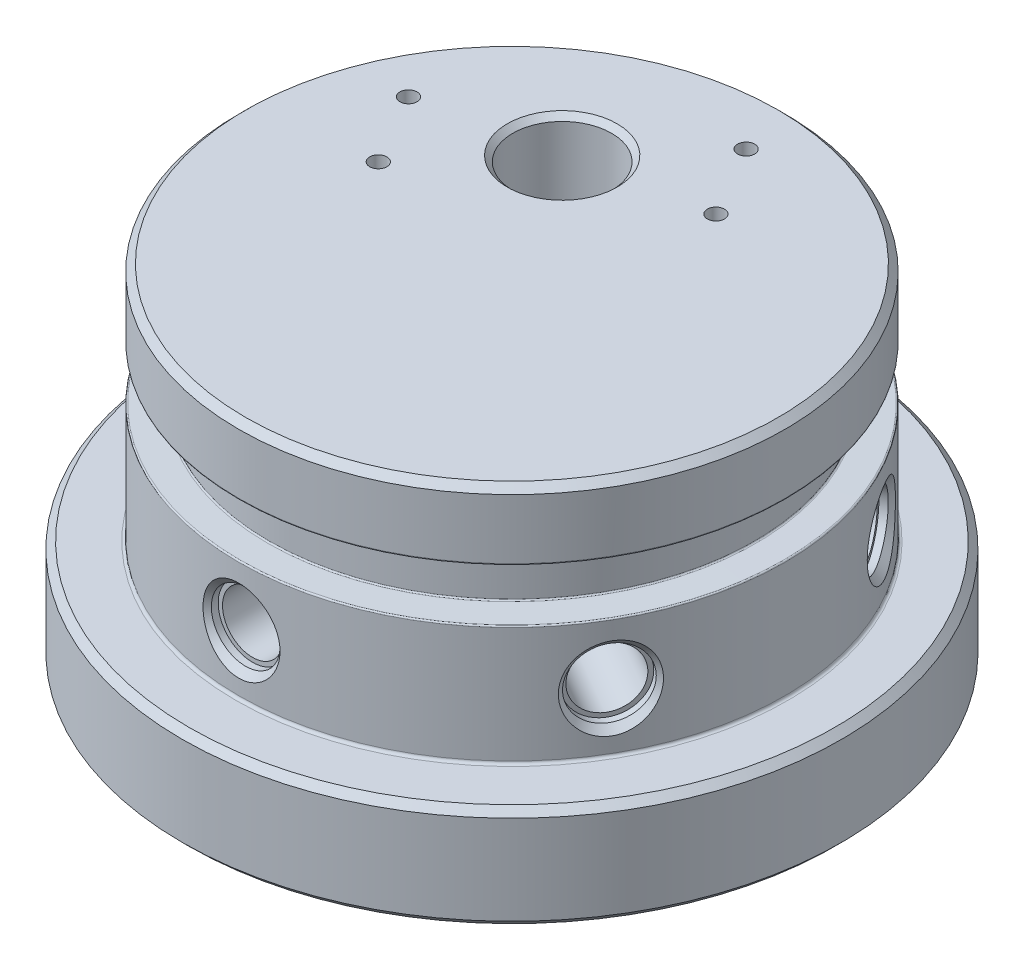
ISO-10303-21;
HEADER;
FILE_DESCRIPTION(('STEP AP214'),'2;1');
FILE_NAME('part.step','',(''),(''),'','','');
FILE_SCHEMA(('AUTOMOTIVE_DESIGN { 1 0 10303 214 1 1 1 1 }'));
ENDSEC;
DATA;
#1=APPLICATION_CONTEXT('core data for automotive mechanical design processes');
#2=APPLICATION_PROTOCOL_DEFINITION('international standard','automotive_design',2000,#1);
#3=PRODUCT_CONTEXT('',#1,'mechanical');
#4=PRODUCT('Part','Part','',(#3));
#5=PRODUCT_RELATED_PRODUCT_CATEGORY('part','',(#4));
#6=PRODUCT_DEFINITION_FORMATION('','',#4);
#7=PRODUCT_DEFINITION_CONTEXT('part definition',#1,'design');
#8=PRODUCT_DEFINITION('design','',#6,#7);
#9=PRODUCT_DEFINITION_SHAPE('','',#8);
#10=(LENGTH_UNIT() NAMED_UNIT(*) SI_UNIT(.MILLI.,.METRE.));
#11=(NAMED_UNIT(*) PLANE_ANGLE_UNIT() SI_UNIT($,.RADIAN.));
#12=(NAMED_UNIT(*) SI_UNIT($,.STERADIAN.) SOLID_ANGLE_UNIT());
#13=UNCERTAINTY_MEASURE_WITH_UNIT(LENGTH_MEASURE(1.E-05),#10,'distance_accuracy_value','');
#14=(GEOMETRIC_REPRESENTATION_CONTEXT(3) GLOBAL_UNCERTAINTY_ASSIGNED_CONTEXT((#13)) GLOBAL_UNIT_ASSIGNED_CONTEXT((#10,
#11,#12)) REPRESENTATION_CONTEXT('',''));
#15=CARTESIAN_POINT('',(0.,0.,0.));
#16=DIRECTION('',(0.,0.,1.));
#17=DIRECTION('',(1.,0.,0.));
#18=AXIS2_PLACEMENT_3D('',#15,#16,#17);
#19=CARTESIAN_POINT('',(0.,-15.875,0.));
#20=DIRECTION('',(0.,1.,0.));
#21=DIRECTION('',(0.,0.,1.));
#22=AXIS2_PLACEMENT_3D('',#19,#20,#21);
#23=PLANE('',#22);
#24=CARTESIAN_POINT('',(0.,-15.875,0.));
#25=DIRECTION('',(0.,1.,0.));
#26=DIRECTION('',(0.,0.,1.));
#27=AXIS2_PLACEMENT_3D('',#24,#25,#26);
#28=CIRCLE('',#27,29.845);
#29=CARTESIAN_POINT('',(0.,-15.875,29.845));
#30=VERTEX_POINT('',#29);
#31=EDGE_CURVE('E327',#30,#30,#28,.F.);
#32=ORIENTED_EDGE('',*,*,#31,.T.);
#33=EDGE_LOOP('',(#32));
#34=FACE_BOUND('',#33,.T.);
#35=CARTESIAN_POINT('',(-6.35000000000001,-15.875,-10.9985226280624));
#36=DIRECTION('',(0.,-1.,0.));
#37=DIRECTION('',(0.,0.,-1.));
#38=AXIS2_PLACEMENT_3D('',#35,#36,#37);
#39=CIRCLE('',#38,5.08);
#40=CARTESIAN_POINT('',(-6.35000000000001,-15.875,-16.0785226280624));
#41=VERTEX_POINT('',#40);
#42=EDGE_CURVE('E110',#41,#41,#39,.T.);
#43=ORIENTED_EDGE('',*,*,#42,.F.);
#44=EDGE_LOOP('',(#43));
#45=FACE_BOUND('',#44,.T.);
#46=ADVANCED_FACE('F35',(#34,#45),#23,.F.);
#47=CARTESIAN_POINT('',(0.,17.4625,0.));
#48=DIRECTION('',(0.,1.,0.));
#49=DIRECTION('',(0.,0.,1.));
#50=AXIS2_PLACEMENT_3D('',#47,#48,#49);
#51=CYLINDRICAL_SURFACE('',#50,25.2603);
#52=CARTESIAN_POINT('',(0.,-6.096,0.));
#53=DIRECTION('',(0.,1.,0.));
#54=DIRECTION('',(0.,0.,1.));
#55=AXIS2_PLACEMENT_3D('',#52,#53,#54);
#56=CIRCLE('',#55,25.2603);
#57=CARTESIAN_POINT('',(0.,-6.096,25.2603));
#58=VERTEX_POINT('',#57);
#59=EDGE_CURVE('E43',#58,#58,#56,.T.);
#60=ORIENTED_EDGE('',*,*,#59,.T.);
#61=EDGE_LOOP('',(#60));
#62=FACE_BOUND('',#61,.T.);
#63=CARTESIAN_POINT('',(22.9794434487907,-3.68504848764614,10.489421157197));
#64=CARTESIAN_POINT('',(23.0336895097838,-3.55712648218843,10.370583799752));
#65=CARTESIAN_POINT('',(23.0830856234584,-3.41947857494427,10.2599288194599));
#66=CARTESIAN_POINT('',(23.1721227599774,-3.12814077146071,10.0572245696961));
#67=CARTESIAN_POINT('',(23.2117540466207,-2.97443508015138,9.96519388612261));
#68=CARTESIAN_POINT('',(23.2870311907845,-2.6281841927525,9.78814059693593));
#69=CARTESIAN_POINT('',(23.3209602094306,-2.43340155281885,9.70673667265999));
#70=CARTESIAN_POINT('',(23.3759113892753,-2.03220728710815,9.57364732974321));
#71=CARTESIAN_POINT('',(23.3969291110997,-1.82579168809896,9.52197213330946));
#72=CARTESIAN_POINT('',(23.4268892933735,-1.39760359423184,9.44803209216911));
#73=CARTESIAN_POINT('',(23.4352685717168,-1.17555331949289,9.42713983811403));
#74=CARTESIAN_POINT('',(23.4382813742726,-0.730777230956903,9.41964609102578));
#75=CARTESIAN_POINT('',(23.4329135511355,-0.508051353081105,9.43304795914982));
#76=CARTESIAN_POINT('',(23.4081663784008,-0.0644442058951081,9.49429352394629));
#77=CARTESIAN_POINT('',(23.3885602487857,0.156347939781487,9.54269461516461));
#78=CARTESIAN_POINT('',(23.3348608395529,0.585902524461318,9.67326089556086));
#79=CARTESIAN_POINT('',(23.3007668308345,0.794664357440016,9.75542778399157));
#80=CARTESIAN_POINT('',(23.2182838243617,1.19140219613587,9.95012861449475));
#81=CARTESIAN_POINT('',(23.1700643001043,1.37959023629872,10.0623012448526));
#82=CARTESIAN_POINT('',(23.0589970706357,1.73163826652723,10.3142762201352));
#83=CARTESIAN_POINT('',(22.9961523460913,1.89550320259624,10.4540729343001));
#84=CARTESIAN_POINT('',(22.8591221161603,2.18607576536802,10.750287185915));
#85=CARTESIAN_POINT('',(22.7855644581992,2.31411071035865,10.9056904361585));
#86=CARTESIAN_POINT('',(22.6259936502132,2.53707048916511,11.2329954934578));
#87=CARTESIAN_POINT('',(22.5399871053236,2.63201279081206,11.4048885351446));
#88=CARTESIAN_POINT('',(22.3636413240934,2.77900350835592,11.7466854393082));
#89=CARTESIAN_POINT('',(22.2740393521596,2.83361181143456,11.9158693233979));
#90=CARTESIAN_POINT('',(22.08766224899,2.90799276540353,12.2578861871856));
#91=CARTESIAN_POINT('',(21.9908901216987,2.92777991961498,12.4307176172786));
#92=CARTESIAN_POINT('',(21.7987982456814,2.93150079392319,12.7644077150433));
#93=CARTESIAN_POINT('',(21.7037146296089,2.91742959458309,12.9253836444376));
#94=CARTESIAN_POINT('',(21.5126632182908,2.85816073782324,13.240925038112));
#95=CARTESIAN_POINT('',(21.4166954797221,2.81296506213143,13.3954909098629));
#96=CARTESIAN_POINT('',(21.2273879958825,2.69358156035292,13.6934952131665));
#97=CARTESIAN_POINT('',(21.1340378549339,2.6195338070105,13.8369834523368));
#98=CARTESIAN_POINT('',(20.9523889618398,2.44516657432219,14.1105334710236));
#99=CARTESIAN_POINT('',(20.8640911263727,2.34484234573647,14.2405928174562));
#100=CARTESIAN_POINT('',(20.6911744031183,2.11584246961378,14.4907660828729));
#101=CARTESIAN_POINT('',(20.6069319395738,1.98604267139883,14.6101096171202));
#102=CARTESIAN_POINT('',(20.4495499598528,1.70523531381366,14.8295968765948));
#103=CARTESIAN_POINT('',(20.376413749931,1.55422146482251,14.9297348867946));
#104=CARTESIAN_POINT('',(20.2388799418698,1.22413614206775,15.1157141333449));
#105=CARTESIAN_POINT('',(20.1754285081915,1.04384959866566,15.2000996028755));
#106=CARTESIAN_POINT('',(20.0658540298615,0.668822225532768,15.3444613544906));
#107=CARTESIAN_POINT('',(20.0197356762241,0.474077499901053,15.4044310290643));
#108=CARTESIAN_POINT('',(19.9443322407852,0.0641207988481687,15.5019488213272));
#109=CARTESIAN_POINT('',(19.916117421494,-0.151627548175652,15.5380758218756));
#110=CARTESIAN_POINT('',(19.8817347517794,-0.587722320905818,15.5820460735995));
#111=CARTESIAN_POINT('',(19.87557059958,-0.808069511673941,15.5898845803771));
#112=CARTESIAN_POINT('',(19.8856533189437,-1.25315030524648,15.5770225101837));
#113=CARTESIAN_POINT('',(19.9024840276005,-1.47784993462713,15.5555784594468));
#114=CARTESIAN_POINT('',(19.9589547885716,-1.91949705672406,15.4830542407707));
#115=CARTESIAN_POINT('',(19.9985966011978,-2.13644394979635,15.4319717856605));
#116=CARTESIAN_POINT('',(20.099052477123,-2.55574291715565,15.3009025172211));
#117=CARTESIAN_POINT('',(20.1598205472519,-2.75812555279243,15.220978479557));
#118=CARTESIAN_POINT('',(20.300202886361,-3.14244149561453,15.0332365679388));
#119=CARTESIAN_POINT('',(20.3798154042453,-3.32437670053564,14.9254212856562));
#120=CARTESIAN_POINT('',(20.5518418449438,-3.65584896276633,14.6875908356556));
#121=CARTESIAN_POINT('',(20.6437486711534,-3.80625471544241,14.5584223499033));
#122=CARTESIAN_POINT('',(20.8386498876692,-4.07621025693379,14.2780412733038));
#123=CARTESIAN_POINT('',(20.9416393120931,-4.19577378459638,14.1268385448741));
#124=CARTESIAN_POINT('',(21.1475567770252,-4.39220026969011,13.816510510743));
#125=CARTESIAN_POINT('',(21.2500547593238,-4.47133140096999,13.6585367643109));
#126=CARTESIAN_POINT('',(21.4571854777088,-4.5945055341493,13.3307695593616));
#127=CARTESIAN_POINT('',(21.5618170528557,-4.63856712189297,13.1609824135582));
#128=CARTESIAN_POINT('',(21.7622829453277,-4.68778902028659,12.8265831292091));
#129=CARTESIAN_POINT('',(21.8582345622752,-4.6953730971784,12.662394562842));
#130=CARTESIAN_POINT('',(22.0456563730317,-4.67789445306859,12.333192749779));
#131=CARTESIAN_POINT('',(22.1371267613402,-4.65283315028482,12.1681795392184));
#132=CARTESIAN_POINT('',(22.3109842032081,-4.57216402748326,11.84632593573));
#133=CARTESIAN_POINT('',(22.3935376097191,-4.51731082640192,11.6893843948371));
#134=CARTESIAN_POINT('',(22.5503567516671,-4.37972901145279,11.3839201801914));
#135=CARTESIAN_POINT('',(22.6246266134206,-4.29701435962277,11.2353933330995));
#136=CARTESIAN_POINT('',(22.7473426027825,-4.12924417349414,10.9843457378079));
#137=CARTESIAN_POINT('',(22.7977397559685,-4.04937849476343,10.8792577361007));
#138=CARTESIAN_POINT('',(22.8928668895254,-3.87661853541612,10.6776318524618));
#139=CARTESIAN_POINT('',(22.93759816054,-3.78372723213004,10.5810920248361));
#140=CARTESIAN_POINT('',(22.9794434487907,-3.68504848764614,10.489421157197));
#141=B_SPLINE_CURVE_WITH_KNOTS('',3,(#63,#64,#65,#66,#67,#68,#69,#70,#71,#72,#73,#74,#75,#76,
#77,#78,#79,#80,#81,#82,#83,#84,#85,#86,#87,#88,#89,#90,#91,#92,#93,#94,#95,#96,#97,#98,#99,
#100,#101,#102,#103,#104,#105,#106,#107,#108,#109,#110,#111,#112,#113,#114,#115,#116,#117,#118,
#119,#120,#121,#122,#123,#124,#125,#126,#127,#128,#129,#130,#131,#132,#133,#134,#135,#136,#137,
#138,#139,#140),.UNSPECIFIED.,.T.,.F.,(4,2,2,2,2,2,2,2,2,2,2,2,2,2,2,2,2,2,2,2,2,2,2,2,2,2,2,2,
2,2,2,2,2,2,2,2,2,2,4),(0.,0.548112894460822,1.09677010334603,1.73532001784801,2.37408936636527,
3.04055959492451,3.70709514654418,4.38448647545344,5.06191189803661,5.73152122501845,
6.40099420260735,7.04072568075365,7.68011896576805,8.27426683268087,8.86816717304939,
9.42793717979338,9.98767154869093,10.5447216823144,11.10187256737,11.6856011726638,
12.269503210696,12.8935392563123,13.5177440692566,14.1764204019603,14.8352071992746,
15.511035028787,16.18691501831,16.8613326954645,17.5356877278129,18.1878655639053,
18.8397523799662,19.4493195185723,20.0585633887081,20.6267075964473,21.1948271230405,
21.7491853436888,22.3032661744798,22.7261757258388,23.1489887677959),.UNSPECIFIED.);
#142=CARTESIAN_POINT('',(22.9794434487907,-3.68504848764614,10.489421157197));
#143=VERTEX_POINT('',#142);
#144=EDGE_CURVE('E340',#143,#143,#141,.T.);
#145=ORIENTED_EDGE('',*,*,#144,.F.);
#146=EDGE_LOOP('',(#145));
#147=FACE_BOUND('',#146,.T.);
#148=CARTESIAN_POINT('',(20.6132994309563,-3.75011250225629,-14.6005014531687));
#149=CARTESIAN_POINT('',(20.5357846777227,-3.62532930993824,-14.7099388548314));
#150=CARTESIAN_POINT('',(20.4627657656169,-3.49048948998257,-14.8111793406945));
#151=CARTESIAN_POINT('',(20.3277046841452,-3.20412025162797,-14.9960101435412));
#152=CARTESIAN_POINT('',(20.2656738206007,-3.0525739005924,-15.0795822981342));
#153=CARTESIAN_POINT('',(20.1455546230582,-2.71151719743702,-15.2397821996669));
#154=CARTESIAN_POINT('',(20.0895975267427,-2.51977515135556,-15.3132834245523));
#155=CARTESIAN_POINT('',(19.9965589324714,-2.12397922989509,-15.4345796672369));
#156=CARTESIAN_POINT('',(19.9594835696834,-1.91992137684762,-15.4823663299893));
#157=CARTESIAN_POINT('',(19.9042489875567,-1.49529033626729,-15.553320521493));
#158=CARTESIAN_POINT('',(19.8870316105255,-1.2743885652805,-15.5752632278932));
#159=CARTESIAN_POINT('',(19.8752881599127,-0.831002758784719,-15.5902457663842));
#160=CARTESIAN_POINT('',(19.88076459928,-0.60851855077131,-15.5832823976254));
#161=CARTESIAN_POINT('',(19.9145173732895,-0.163971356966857,-15.5401261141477));
#162=CARTESIAN_POINT('',(19.9432118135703,0.0580083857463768,-15.5033971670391));
#163=CARTESIAN_POINT('',(20.0228267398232,0.490903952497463,-15.4004340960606));
#164=CARTESIAN_POINT('',(20.0737485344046,0.701819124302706,-15.3341982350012));
#165=CARTESIAN_POINT('',(20.1952680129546,1.10424855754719,-15.1737897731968));
#166=CARTESIAN_POINT('',(20.2656769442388,1.29592602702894,-15.0798846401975));
#167=CARTESIAN_POINT('',(20.4236477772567,1.6558023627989,-14.8652297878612));
#168=CARTESIAN_POINT('',(20.5112066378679,1.82400538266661,-14.7444848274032));
#169=CARTESIAN_POINT('',(20.6960078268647,2.12423957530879,-14.4838670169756));
#170=CARTESIAN_POINT('',(20.7926921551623,2.25748915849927,-14.3450051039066));
#171=CARTESIAN_POINT('',(20.9948102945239,2.49131787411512,-14.0475232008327));
#172=CARTESIAN_POINT('',(21.100239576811,2.59191378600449,-13.8889134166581));
#173=CARTESIAN_POINT('',(21.3080095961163,2.7501047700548,-13.5678092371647));
#174=CARTESIAN_POINT('',(21.4100520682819,2.81021166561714,-13.406359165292));
#175=CARTESIAN_POINT('',(21.6142598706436,2.89547188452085,-13.0745699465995));
#176=CARTESIAN_POINT('',(21.7164251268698,2.92064060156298,-12.9042347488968));
#177=CARTESIAN_POINT('',(21.9112222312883,2.93442644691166,-12.5704496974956));
#178=CARTESIAN_POINT('',(22.0040578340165,2.92515162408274,-12.4072021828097));
#179=CARTESIAN_POINT('',(22.1840476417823,2.87512020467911,-12.0824356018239));
#180=CARTESIAN_POINT('',(22.2712023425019,2.83436635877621,-11.9209163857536));
#181=CARTESIAN_POINT('',(22.4370078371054,2.72358901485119,-11.6058124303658));
#182=CARTESIAN_POINT('',(22.5157300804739,2.65384081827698,-11.452167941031));
#183=CARTESIAN_POINT('',(22.6642541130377,2.48771154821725,-11.1553540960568));
#184=CARTESIAN_POINT('',(22.7340544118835,2.39132603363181,-11.0121864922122));
#185=CARTESIAN_POINT('',(22.8668562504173,2.17027424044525,-10.7338020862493));
#186=CARTESIAN_POINT('',(22.9294151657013,2.0445375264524,-10.5992255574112));
#187=CARTESIAN_POINT('',(23.0435817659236,1.77144230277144,-10.3486759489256));
#188=CARTESIAN_POINT('',(23.0951862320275,1.62407745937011,-10.2327083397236));
#189=CARTESIAN_POINT('',(23.1905634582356,1.30108933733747,-10.0147721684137));
#190=CARTESIAN_POINT('',(23.233557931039,1.12422200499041,-9.91430603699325));
#191=CARTESIAN_POINT('',(23.3071610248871,0.755428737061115,-9.74001927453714));
#192=CARTESIAN_POINT('',(23.3377662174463,0.563498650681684,-9.66620601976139));
#193=CARTESIAN_POINT('',(23.3882073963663,0.158265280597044,-9.54354235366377));
#194=CARTESIAN_POINT('',(23.407328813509,-0.0556326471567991,-9.49635765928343));
#195=CARTESIAN_POINT('',(23.4321654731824,-0.488873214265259,-9.43490746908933));
#196=CARTESIAN_POINT('',(23.4378783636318,-0.708216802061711,-9.42064774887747));
#197=CARTESIAN_POINT('',(23.4359322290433,-1.15267097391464,-9.4254899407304));
#198=CARTESIAN_POINT('',(23.4278928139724,-1.37777035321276,-9.44554089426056));
#199=CARTESIAN_POINT('',(23.3976079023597,-1.82118180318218,-9.52031018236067));
#200=CARTESIAN_POINT('',(23.3753612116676,-2.03949330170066,-9.57503143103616));
#201=CARTESIAN_POINT('',(23.3164266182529,-2.46293750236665,-9.71766080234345));
#202=CARTESIAN_POINT('',(23.2797403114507,-2.66807165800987,-9.80556525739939));
#203=CARTESIAN_POINT('',(23.1916373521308,-3.05880300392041,-10.0121561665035));
#204=CARTESIAN_POINT('',(23.1402217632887,-3.24440160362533,-10.130840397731));
#205=CARTESIAN_POINT('',(23.0243048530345,-3.58439815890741,-10.391526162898));
#206=CARTESIAN_POINT('',(22.9602476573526,-3.73957161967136,-10.5327114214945));
#207=CARTESIAN_POINT('',(22.8183937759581,-4.01967571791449,-10.8365892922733));
#208=CARTESIAN_POINT('',(22.740602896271,-4.14461908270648,-10.9992728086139));
#209=CARTESIAN_POINT('',(22.5775620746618,-4.35209234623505,-11.3299702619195));
#210=CARTESIAN_POINT('',(22.4930921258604,-4.43680043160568,-11.4970007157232));
#211=CARTESIAN_POINT('',(22.3145570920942,-4.57117655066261,-11.8397856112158));
#212=CARTESIAN_POINT('',(22.2204972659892,-4.62086367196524,-12.0155352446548));
#213=CARTESIAN_POINT('',(22.0320649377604,-4.68069249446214,-12.3574405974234));
#214=CARTESIAN_POINT('',(21.9381612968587,-4.69332495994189,-12.5234221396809));
#215=CARTESIAN_POINT('',(21.7469266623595,-4.68562527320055,-12.8526318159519));
#216=CARTESIAN_POINT('',(21.6495958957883,-4.66529530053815,-13.0158601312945));
#217=CARTESIAN_POINT('',(21.4574287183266,-4.59362589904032,-13.3302112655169));
#218=CARTESIAN_POINT('',(21.3626002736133,-4.54318673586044,-13.4815465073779));
#219=CARTESIAN_POINT('',(21.1756516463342,-4.41406695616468,-13.7733273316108));
#220=CARTESIAN_POINT('',(21.0835300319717,-4.33540157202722,-13.9137787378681));
#221=CARTESIAN_POINT('',(20.9268424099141,-4.17521926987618,-14.1479594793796));
#222=CARTESIAN_POINT('',(20.861073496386,-4.09916654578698,-14.2446817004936));
#223=CARTESIAN_POINT('',(20.7337705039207,-3.93404929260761,-14.4293479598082));
#224=CARTESIAN_POINT('',(20.6722354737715,-3.84498770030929,-14.5172939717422));
#225=CARTESIAN_POINT('',(20.6132994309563,-3.75011250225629,-14.6005014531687));
#226=B_SPLINE_CURVE_WITH_KNOTS('',3,(#148,#149,#150,#151,#152,#153,#154,#155,#156,#157,#158,
#159,#160,#161,#162,#163,#164,#165,#166,#167,#168,#169,#170,#171,#172,#173,#174,#175,#176,#177,
#178,#179,#180,#181,#182,#183,#184,#185,#186,#187,#188,#189,#190,#191,#192,#193,#194,#195,#196,
#197,#198,#199,#200,#201,#202,#203,#204,#205,#206,#207,#208,#209,#210,#211,#212,#213,#214,#215,
#216,#217,#218,#219,#220,#221,#222,#223,#224,#225),.UNSPECIFIED.,.T.,.F.,(4,2,2,2,2,2,2,2,2,2,2,
2,2,2,2,2,2,2,2,2,2,2,2,2,2,2,2,2,2,2,2,2,2,2,2,2,2,2,4),(0.,0.549152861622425,1.09886751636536,
1.73449374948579,2.37032638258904,3.0352149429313,3.70017713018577,4.37738761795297,
5.0546379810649,5.72554517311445,6.3963335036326,7.03907322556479,7.68148214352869,
8.27904044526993,8.87633538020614,9.43769354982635,9.99900267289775,10.5550996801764,
11.1112894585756,11.6923090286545,12.2734990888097,12.8944879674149,13.5156485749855,
14.1722714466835,14.829009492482,15.5042080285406,16.1794633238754,16.8546440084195,
17.5297759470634,18.1844337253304,18.8388154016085,19.4519209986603,20.0646921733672,
20.6352066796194,21.2056834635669,21.7599019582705,22.3138218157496,22.7314480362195,
23.1489801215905),.UNSPECIFIED.);
#227=CARTESIAN_POINT('',(20.6132994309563,-3.75011250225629,-14.6005014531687));
#228=VERTEX_POINT('',#227);
#229=EDGE_CURVE('E344',#228,#228,#226,.T.);
#230=ORIENTED_EDGE('',*,*,#229,.F.);
#231=EDGE_LOOP('',(#230));
#232=FACE_BOUND('',#231,.T.);
#233=CARTESIAN_POINT('',(-2.59037019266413,-3.48957065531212,-25.1271315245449));
#234=CARTESIAN_POINT('',(-2.71013021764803,-3.35328418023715,-25.1147858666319));
#235=CARTESIAN_POINT('',(-2.81996486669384,-3.20821087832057,-25.1025990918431));
#236=CARTESIAN_POINT('',(-3.01811026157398,-2.90384995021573,-25.0795481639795));
#237=CARTESIAN_POINT('',(-3.10640137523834,-2.74454953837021,-25.0686852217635));
#238=CARTESIAN_POINT('',(-3.27435677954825,-2.38466328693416,-25.0473518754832));
#239=CARTESIAN_POINT('',(-3.34941805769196,-2.18188542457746,-25.0373243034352));
#240=CARTESIAN_POINT('',(-3.46605089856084,-1.76674283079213,-25.0214452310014));
#241=CARTESIAN_POINT('',(-3.50760920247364,-1.55437433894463,-25.0155953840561));
#242=CARTESIAN_POINT('',(-3.55736151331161,-1.1177640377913,-25.008570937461));
#243=CARTESIAN_POINT('',(-3.56427625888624,-0.893372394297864,-25.0075756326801));
#244=CARTESIAN_POINT('',(-3.54113630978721,-0.446536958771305,-25.0108623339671));
#245=CARTESIAN_POINT('',(-3.51107927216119,-0.224093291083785,-25.0151446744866));
#246=CARTESIAN_POINT('',(-3.41407094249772,0.214899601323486,-25.0285694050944));
#247=CARTESIAN_POINT('',(-3.34674046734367,0.431363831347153,-25.0377617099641));
#248=CARTESIAN_POINT('',(-3.17626378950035,0.849541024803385,-25.0599571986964));
#249=CARTESIAN_POINT('',(-3.07311684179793,1.05125368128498,-25.0729604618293));
#250=CARTESIAN_POINT('',(-2.8353482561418,1.43003289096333,-25.1009478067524));
#251=CARTESIAN_POINT('',(-2.70132377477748,1.60747633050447,-25.115892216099));
#252=CARTESIAN_POINT('',(-2.40385760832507,1.93573613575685,-25.1461028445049));
#253=CARTESIAN_POINT('',(-2.24042425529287,2.0865600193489,-25.1613689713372));
#254=CARTESIAN_POINT('',(-1.89751639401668,2.34861018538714,-25.1894856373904));
#255=CARTESIAN_POINT('',(-1.71930674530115,2.46147957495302,-25.2024202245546));
#256=CARTESIAN_POINT('',(-1.34521522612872,2.65309854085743,-25.2251489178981));
#257=CARTESIAN_POINT('',(-1.14934314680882,2.73186688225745,-25.2349447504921));
#258=CARTESIAN_POINT('',(-0.760747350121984,2.8472475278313,-25.2495359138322));
#259=CARTESIAN_POINT('',(-0.568814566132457,2.88648945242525,-25.2546408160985));
#260=CARTESIAN_POINT('',(-0.180992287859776,2.93063725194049,-25.2603947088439));
#261=CARTESIAN_POINT('',(0.0148958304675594,2.93555486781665,-25.2610452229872));
#262=CARTESIAN_POINT('',(0.394931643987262,2.91145662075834,-25.2578933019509));
#263=CARTESIAN_POINT('',(0.579187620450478,2.88407658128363,-25.2543055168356));
#264=CARTESIAN_POINT('',(0.940492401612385,2.79921558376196,-25.2434330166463));
#265=CARTESIAN_POINT('',(1.1175412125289,2.74173465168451,-25.236148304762));
#266=CARTESIAN_POINT('',(1.46115146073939,2.59834867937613,-25.2185974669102));
#267=CARTESIAN_POINT('',(1.62762011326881,2.51222498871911,-25.2083084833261));
#268=CARTESIAN_POINT('',(1.94466821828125,2.31473109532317,-25.1858358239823));
#269=CARTESIAN_POINT('',(2.09524421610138,2.20335541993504,-25.1736517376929));
#270=CARTESIAN_POINT('',(2.38523615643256,1.95205126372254,-25.1478782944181));
#271=CARTESIAN_POINT('',(2.52357400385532,1.81088413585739,-25.1342484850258));
#272=CARTESIAN_POINT('',(2.77639962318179,1.50856943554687,-25.1075797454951));
#273=CARTESIAN_POINT('',(2.89088015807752,1.34741582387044,-25.0945409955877));
#274=CARTESIAN_POINT('',(3.1009213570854,0.997868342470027,-25.0694838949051));
#275=CARTESIAN_POINT('',(3.19465357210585,0.808365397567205,-25.0575962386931));
#276=CARTESIAN_POINT('',(3.35085946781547,0.416718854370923,-25.0371867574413));
#277=CARTESIAN_POINT('',(3.41332530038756,0.214572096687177,-25.0286657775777));
#278=CARTESIAN_POINT('',(3.50818019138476,-0.207346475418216,-25.0155526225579));
#279=CARTESIAN_POINT('',(3.53892759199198,-0.427495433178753,-25.011175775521));
#280=CARTESIAN_POINT('',(3.56417214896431,-0.869915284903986,-25.0075906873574));
#281=CARTESIAN_POINT('',(3.55866397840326,-1.09218648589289,-25.0083832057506));
#282=CARTESIAN_POINT('',(3.51102614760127,-1.53713624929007,-25.0151163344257));
#283=CARTESIAN_POINT('',(3.4681793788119,-1.75973707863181,-25.0211577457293));
#284=CARTESIAN_POINT('',(3.34572689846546,-2.19444634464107,-25.0378245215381));
#285=CARTESIAN_POINT('',(3.26611915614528,-2.40655420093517,-25.0484501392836));
#286=CARTESIAN_POINT('',(3.07255100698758,-2.81219538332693,-25.0729254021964));
#287=CARTESIAN_POINT('',(2.95887380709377,-3.00586513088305,-25.086748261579));
#288=CARTESIAN_POINT('',(2.69936424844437,-3.37023845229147,-25.1159943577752));
#289=CARTESIAN_POINT('',(2.5535370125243,-3.54094567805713,-25.1314173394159));
#290=CARTESIAN_POINT('',(2.23970182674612,-3.846799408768,-25.161285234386));
#291=CARTESIAN_POINT('',(2.0728233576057,-3.98310097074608,-25.1757445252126));
#292=CARTESIAN_POINT('',(1.71701538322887,-4.22331429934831,-25.2025062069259));
#293=CARTESIAN_POINT('',(1.52809704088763,-4.32724236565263,-25.2148096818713));
#294=CARTESIAN_POINT('',(1.14760079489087,-4.49207549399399,-25.2348865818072));
#295=CARTESIAN_POINT('',(0.95710977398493,-4.55545826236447,-25.2429143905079));
#296=CARTESIAN_POINT('',(0.567765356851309,-4.64721450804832,-25.2546675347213));
#297=CARTESIAN_POINT('',(0.368915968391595,-4.67560457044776,-25.2583949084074));
#298=CARTESIAN_POINT('',(-0.018296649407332,-4.69541935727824,-25.2609898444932));
#299=CARTESIAN_POINT('',(-0.206549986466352,-4.68901650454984,-25.260143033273));
#300=CARTESIAN_POINT('',(-0.57921043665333,-4.64451990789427,-25.2543460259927));
#301=CARTESIAN_POINT('',(-0.763617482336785,-4.60642560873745,-25.2493957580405));
#302=CARTESIAN_POINT('',(-1.12123671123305,-4.50077533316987,-25.2360313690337));
#303=CARTESIAN_POINT('',(-1.29455482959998,-4.43357015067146,-25.2276585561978));
#304=CARTESIAN_POINT('',(-1.62795851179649,-4.27231595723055,-25.2083398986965));
#305=CARTESIAN_POINT('',(-1.78804930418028,-4.17827761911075,-25.197395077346));
#306=CARTESIAN_POINT('',(-2.05950112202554,-3.98888367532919,-25.1764908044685));
#307=CARTESIAN_POINT('',(-2.17402549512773,-3.89797354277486,-25.1668090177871));
#308=CARTESIAN_POINT('',(-2.39129519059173,-3.70312530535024,-25.1470943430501));
#309=CARTESIAN_POINT('',(-2.49404330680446,-3.59919030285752,-25.1370615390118));
#310=CARTESIAN_POINT('',(-2.59037019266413,-3.48957065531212,-25.1271315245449));
#311=B_SPLINE_CURVE_WITH_KNOTS('',3,(#233,#234,#235,#236,#237,#238,#239,#240,#241,#242,#243,
#244,#245,#246,#247,#248,#249,#250,#251,#252,#253,#254,#255,#256,#257,#258,#259,#260,#261,#262,
#263,#264,#265,#266,#267,#268,#269,#270,#271,#272,#273,#274,#275,#276,#277,#278,#279,#280,#281,
#282,#283,#284,#285,#286,#287,#288,#289,#290,#291,#292,#293,#294,#295,#296,#297,#298,#299,#300,
#301,#302,#303,#304,#305,#306,#307,#308,#309,#310),.UNSPECIFIED.,.T.,.F.,(4,2,2,2,2,2,2,2,2,2,2,
2,2,2,2,2,2,2,2,2,2,2,2,2,2,2,2,2,2,2,2,2,2,2,2,2,2,2,4),(0.,0.545151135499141,1.09079721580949,
1.73719326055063,2.38384499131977,3.05420783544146,3.72461316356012,4.40196730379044,
5.07933553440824,5.74456519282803,6.40960667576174,7.04029191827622,7.67062966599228,
8.25552742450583,8.84022510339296,9.39653668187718,9.95284778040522,10.5135069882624,
11.0742878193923,11.6660892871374,12.2580700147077,12.8905204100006,13.5231294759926,
14.1870492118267,14.8510664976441,15.5281248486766,16.2052206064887,16.8768370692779,
17.5483465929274,18.1928187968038,18.836965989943,19.4365789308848,20.0359075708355,
20.5982623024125,21.1606268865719,21.7163955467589,22.2719434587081,22.7105305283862,
23.149013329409),.UNSPECIFIED.);
#312=CARTESIAN_POINT('',(-2.59037019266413,-3.48957065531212,-25.1271315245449));
#313=VERTEX_POINT('',#312);
#314=EDGE_CURVE('E348',#313,#313,#311,.T.);
#315=ORIENTED_EDGE('',*,*,#314,.F.);
#316=EDGE_LOOP('',(#315));
#317=FACE_BOUND('',#316,.T.);
#318=CARTESIAN_POINT('',(-21.5964251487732,-4.64436848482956,-13.1025670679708));
#319=CARTESIAN_POINT('',(-21.6932637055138,-4.67567903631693,-12.9429472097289));
#320=CARTESIAN_POINT('',(-21.7897637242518,-4.69105306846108,-12.7798592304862));
#321=CARTESIAN_POINT('',(-21.9790037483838,-4.68916465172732,-12.4515897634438));
#322=CARTESIAN_POINT('',(-22.0717407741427,-4.67187683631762,-12.2864067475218));
#323=CARTESIAN_POINT('',(-22.2486410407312,-4.60621471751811,-11.9630220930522));
#324=CARTESIAN_POINT('',(-22.3329576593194,-4.55860441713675,-11.8047482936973));
#325=CARTESIAN_POINT('',(-22.4936778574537,-4.4349205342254,-11.4955472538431));
#326=CARTESIAN_POINT('',(-22.5700820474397,-4.35884914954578,-11.344619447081));
#327=CARTESIAN_POINT('',(-22.7157172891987,-4.17860764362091,-11.0501885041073));
#328=CARTESIAN_POINT('',(-22.784702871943,-4.07374263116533,-10.9069904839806));
#329=CARTESIAN_POINT('',(-22.9124065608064,-3.84040852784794,-10.636110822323));
#330=CARTESIAN_POINT('',(-22.9711217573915,-3.71193276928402,-10.508433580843));
#331=CARTESIAN_POINT('',(-23.0814399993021,-3.42628016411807,-10.263967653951));
#332=CARTESIAN_POINT('',(-23.1323487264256,-3.26779382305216,-10.1483962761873));
#333=CARTESIAN_POINT('',(-23.2222678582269,-2.93297266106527,-9.94091794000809));
#334=CARTESIAN_POINT('',(-23.2612746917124,-2.75663250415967,-9.84901808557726));
#335=CARTESIAN_POINT('',(-23.3297118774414,-2.37883449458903,-9.68584897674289));
#336=CARTESIAN_POINT('',(-23.3583582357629,-2.17648952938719,-9.61630169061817));
#337=CARTESIAN_POINT('',(-23.4025931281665,-1.76232430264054,-9.50814475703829));
#338=CARTESIAN_POINT('',(-23.418178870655,-1.55050202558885,-9.46954172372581));
#339=CARTESIAN_POINT('',(-23.4368120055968,-1.11442585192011,-9.42333676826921));
#340=CARTESIAN_POINT('',(-23.4393380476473,-0.890011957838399,-9.41702399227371));
#341=CARTESIAN_POINT('',(-23.430473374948,-0.443150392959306,-9.43905729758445));
#342=CARTESIAN_POINT('',(-23.4190810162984,-0.220702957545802,-9.46740747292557));
#343=CARTESIAN_POINT('',(-23.3820549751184,0.218233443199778,-9.55848788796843));
#344=CARTESIAN_POINT('',(-23.3562767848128,0.434638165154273,-9.62156689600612));
#345=CARTESIAN_POINT('',(-23.2901118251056,0.852661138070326,-9.7806354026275));
#346=CARTESIAN_POINT('',(-23.2497249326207,1.05427926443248,-9.87662517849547));
#347=CARTESIAN_POINT('',(-23.154933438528,1.43282486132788,-10.0968250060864));
#348=CARTESIAN_POINT('',(-23.1007941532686,1.61013134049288,-10.2204961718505));
#349=CARTESIAN_POINT('',(-22.9780887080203,1.93809103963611,-10.4934503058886));
#350=CARTESIAN_POINT('',(-22.9095266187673,2.08875175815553,-10.6427260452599));
#351=CARTESIAN_POINT('',(-22.7623059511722,2.35044951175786,-10.9539131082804));
#352=CARTESIAN_POINT('',(-22.6843534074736,2.46313349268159,-11.1147708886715));
#353=CARTESIAN_POINT('',(-22.5169042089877,2.65437164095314,-11.4501872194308));
#354=CARTESIAN_POINT('',(-22.4274139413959,2.73294458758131,-11.6247381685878));
#355=CARTESIAN_POINT('',(-22.2456952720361,2.84794694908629,-11.9685775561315));
#356=CARTESIAN_POINT('',(-22.1541293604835,2.88700618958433,-12.1373382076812));
#357=CARTESIAN_POINT('',(-21.9651764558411,2.93079597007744,-12.4760296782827));
#358=CARTESIAN_POINT('',(-21.8677914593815,2.93553821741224,-12.6459600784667));
#359=CARTESIAN_POINT('',(-21.6750406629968,2.9111114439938,-12.9734247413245));
#360=CARTESIAN_POINT('',(-21.5798054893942,2.88357363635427,-13.1311607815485));
#361=CARTESIAN_POINT('',(-21.389752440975,2.79840954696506,-13.4385233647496));
#362=CARTESIAN_POINT('',(-21.2949345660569,2.74078327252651,-13.5881499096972));
#363=CARTESIAN_POINT('',(-21.1079611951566,2.59711160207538,-13.8768361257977));
#364=CARTESIAN_POINT('',(-21.0158329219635,2.51084349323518,-14.0158021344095));
#365=CARTESIAN_POINT('',(-20.8378952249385,2.31307311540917,-14.2790112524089));
#366=CARTESIAN_POINT('',(-20.7520871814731,2.2015653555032,-14.4032511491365));
#367=CARTESIAN_POINT('',(-20.5848436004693,1.94999476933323,-14.6413566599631));
#368=CARTESIAN_POINT('',(-20.503913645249,1.80869224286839,-14.7542662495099));
#369=CARTESIAN_POINT('',(-20.3545067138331,1.5061222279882,-14.9597121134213));
#370=CARTESIAN_POINT('',(-20.2860335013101,1.34484873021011,-15.0522422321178));
#371=CARTESIAN_POINT('',(-20.1594508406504,0.995073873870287,-15.2214076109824));
#372=CARTESIAN_POINT('',(-20.102369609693,0.805464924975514,-15.2965242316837));
#373=CARTESIAN_POINT('',(-20.0067652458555,0.413628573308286,-15.4213585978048));
#374=CARTESIAN_POINT('',(-19.9682468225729,0.211397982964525,-15.4710698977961));
#375=CARTESIAN_POINT('',(-19.9096692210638,-0.210651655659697,-15.5463904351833));
#376=CARTESIAN_POINT('',(-19.8906164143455,-0.430846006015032,-15.5706870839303));
#377=CARTESIAN_POINT('',(-19.8751176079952,-0.873325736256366,-15.5904653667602));
#378=CARTESIAN_POINT('',(-19.8786748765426,-1.09561141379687,-15.5859428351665));
#379=CARTESIAN_POINT('',(-19.9085609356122,-1.54054520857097,-15.5477509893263));
#380=CARTESIAN_POINT('',(-19.9353342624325,-1.7631151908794,-15.5135126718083));
#381=CARTESIAN_POINT('',(-20.0112231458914,-2.19772336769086,-15.4154959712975));
#382=CARTESIAN_POINT('',(-20.0603392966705,-2.40976128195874,-15.3517168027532));
#383=CARTESIAN_POINT('',(-20.178516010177,-2.81519413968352,-15.1960416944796));
#384=CARTESIAN_POINT('',(-20.2474083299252,-3.00872871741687,-15.1043825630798));
#385=CARTESIAN_POINT('',(-20.4026566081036,-3.37285290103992,-14.8940048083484));
#386=CARTESIAN_POINT('',(-20.4890138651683,-3.54344079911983,-14.7752841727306));
#387=CARTESIAN_POINT('',(-20.6719761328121,-3.84908181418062,-14.5181275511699));
#388=CARTESIAN_POINT('',(-20.7680353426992,-3.98528046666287,-14.3806662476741));
#389=CARTESIAN_POINT('',(-20.9692141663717,-4.22510207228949,-14.0856828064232));
#390=CARTESIAN_POINT('',(-21.0743176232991,-4.32878163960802,-13.9281962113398));
#391=CARTESIAN_POINT('',(-21.2497253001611,-4.46771887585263,-13.6582419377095));
#392=CARTESIAN_POINT('',(-21.3186356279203,-4.51412126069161,-13.5504789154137));
#393=CARTESIAN_POINT('',(-21.4572305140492,-4.59120851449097,-13.3299284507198));
#394=CARTESIAN_POINT('',(-21.526915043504,-4.62189396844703,-13.2171411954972));
#395=CARTESIAN_POINT('',(-21.5964251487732,-4.64436848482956,-13.1025670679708));
#396=B_SPLINE_CURVE_WITH_KNOTS('',3,(#318,#319,#320,#321,#322,#323,#324,#325,#326,#327,#328,
#329,#330,#331,#332,#333,#334,#335,#336,#337,#338,#339,#340,#341,#342,#343,#344,#345,#346,#347,
#348,#349,#350,#351,#352,#353,#354,#355,#356,#357,#358,#359,#360,#361,#362,#363,#364,#365,#366,
#367,#368,#369,#370,#371,#372,#373,#374,#375,#376,#377,#378,#379,#380,#381,#382,#383,#384,#385,
#386,#387,#388,#389,#390,#391,#392,#393,#394,#395),.UNSPECIFIED.,.T.,.F.,(4,2,2,2,2,2,2,2,2,2,2,
2,2,2,2,2,2,2,2,2,2,2,2,2,2,2,2,2,2,2,2,2,2,2,2,2,2,2,4),(0.,0.567401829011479,1.1352445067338,
1.68931718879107,2.2433470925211,2.81214390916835,3.38110160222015,3.98641978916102,
4.59191942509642,5.23664081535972,5.88149997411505,6.55191385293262,7.22240692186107,
7.89975967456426,8.57711813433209,9.24228798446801,9.90727034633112,10.5378426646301,
11.1680673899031,11.7528584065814,12.3374499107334,12.8937294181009,13.4500087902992,
14.010719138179,14.5715515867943,15.1634536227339,15.7555341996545,16.3880824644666,
17.0207911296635,17.6847694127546,18.3488436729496,19.025921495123,19.7030173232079,
20.3745154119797,21.0460634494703,21.6908389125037,22.3344855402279,22.74177815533,
23.1490556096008),.UNSPECIFIED.);
#397=CARTESIAN_POINT('',(-21.5964251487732,-4.64436848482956,-13.1025670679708));
#398=VERTEX_POINT('',#397);
#399=EDGE_CURVE('E352',#398,#398,#396,.T.);
#400=ORIENTED_EDGE('',*,*,#399,.F.);
#401=EDGE_LOOP('',(#400));
#402=FACE_BOUND('',#401,.T.);
#403=CARTESIAN_POINT('',(-22.9302233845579,-3.79557131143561,10.5965849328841));
#404=CARTESIAN_POINT('',(-22.8728221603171,-3.91827956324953,10.7207951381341));
#405=CARTESIAN_POINT('',(-22.8105274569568,-4.03070410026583,10.8529397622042));
#406=CARTESIAN_POINT('',(-22.6765666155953,-4.2316820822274,11.1301286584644));
#407=CARTESIAN_POINT('',(-22.6048976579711,-4.32022832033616,11.2751768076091));
#408=CARTESIAN_POINT('',(-22.4466590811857,-4.47676299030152,11.5872037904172));
#409=CARTESIAN_POINT('',(-22.3593426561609,-4.54238921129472,11.7550006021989));
#410=CARTESIAN_POINT('',(-22.1766610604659,-4.63904668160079,12.0961083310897));
#411=CARTESIAN_POINT('',(-22.0812969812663,-4.67008261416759,12.2694184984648));
#412=CARTESIAN_POINT('',(-21.8908853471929,-4.69536205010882,12.6058368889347));
#413=CARTESIAN_POINT('',(-21.7961303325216,-4.69160422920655,12.7689628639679));
#414=CARTESIAN_POINT('',(-21.6047565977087,-4.65221900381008,13.0901561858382));
#415=CARTESIAN_POINT('',(-21.5081381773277,-4.61659668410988,13.2482243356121));
#416=CARTESIAN_POINT('',(-21.3174873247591,-4.51571824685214,13.5528359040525));
#417=CARTESIAN_POINT('',(-21.2234376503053,-4.45088944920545,13.6995109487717));
#418=CARTESIAN_POINT('',(-21.0394494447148,-4.29418716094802,13.9804348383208));
#419=CARTESIAN_POINT('',(-20.9495115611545,-4.20230942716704,14.1146817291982));
#420=CARTESIAN_POINT('',(-20.7729323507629,-3.99034597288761,14.3733638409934));
#421=CARTESIAN_POINT('',(-20.6865766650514,-3.86925953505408,14.4971724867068));
#422=CARTESIAN_POINT('',(-20.5239714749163,-3.6050042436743,14.7264779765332));
#423=CARTESIAN_POINT('',(-20.4477248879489,-3.46182904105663,14.8319695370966));
#424=CARTESIAN_POINT('',(-20.3028611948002,-3.14704198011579,15.0297254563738));
#425=CARTESIAN_POINT('',(-20.2351142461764,-2.97415907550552,15.1206044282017));
#426=CARTESIAN_POINT('',(-20.1159878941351,-2.61266919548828,15.2787307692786));
#427=CARTESIAN_POINT('',(-20.0646131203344,-2.42405779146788,15.3459714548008));
#428=CARTESIAN_POINT('',(-19.9774009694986,-2.02449609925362,15.4593552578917));
#429=CARTESIAN_POINT('',(-19.9426611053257,-1.81288436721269,15.5040169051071));
#430=CARTESIAN_POINT('',(-19.8946855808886,-1.38327191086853,15.5655314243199));
#431=CARTESIAN_POINT('',(-19.8814538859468,-1.16527001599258,15.5823791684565));
#432=CARTESIAN_POINT('',(-19.8769148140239,-0.721949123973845,15.5881701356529));
#433=CARTESIAN_POINT('',(-19.8862925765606,-0.496610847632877,15.576241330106));
#434=CARTESIAN_POINT('',(-19.9280602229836,-0.0516270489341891,15.5227672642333));
#435=CARTESIAN_POINT('',(-19.9604522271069,0.168017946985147,15.4812192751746));
#436=CARTESIAN_POINT('',(-20.0471027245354,0.595745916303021,15.368846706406));
#437=CARTESIAN_POINT('',(-20.101409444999,0.803802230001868,15.2979575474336));
#438=CARTESIAN_POINT('',(-20.229796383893,1.20142819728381,15.1277694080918));
#439=CARTESIAN_POINT('',(-20.3038755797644,1.39099880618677,15.0284718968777));
#440=CARTESIAN_POINT('',(-20.4666120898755,1.74034418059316,14.8060446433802));
#441=CARTESIAN_POINT('',(-20.5548133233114,1.90079409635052,14.6836440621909));
#442=CARTESIAN_POINT('',(-20.7437212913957,2.19219045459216,14.4155322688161));
#443=CARTESIAN_POINT('',(-20.8444231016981,2.32314845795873,14.2698302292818));
#444=CARTESIAN_POINT('',(-21.047815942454,2.54308594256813,13.9679364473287));
#445=CARTESIAN_POINT('',(-21.1500137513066,2.63413364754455,13.8129211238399));
#446=CARTESIAN_POINT('',(-21.3578945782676,2.78129750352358,13.4892537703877));
#447=CARTESIAN_POINT('',(-21.4635756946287,2.83743239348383,13.3206091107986));
#448=CARTESIAN_POINT('',(-21.6669242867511,2.90946478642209,12.9870170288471));
#449=CARTESIAN_POINT('',(-21.7646330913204,2.92791234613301,12.8226424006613));
#450=CARTESIAN_POINT('',(-21.9563946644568,2.93149471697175,12.4914397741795));
#451=CARTESIAN_POINT('',(-22.0504482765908,2.91663726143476,12.3246123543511));
#452=CARTESIAN_POINT('',(-22.2291458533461,2.85534255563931,11.9992155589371));
#453=CARTESIAN_POINT('',(-22.3139994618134,2.80997961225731,11.8405567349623));
#454=CARTESIAN_POINT('',(-22.4759240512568,2.69060048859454,11.5302322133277));
#455=CARTESIAN_POINT('',(-22.5529944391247,2.6165821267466,11.3785670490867));
#456=CARTESIAN_POINT('',(-22.6998909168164,2.44044171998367,11.0826753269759));
#457=CARTESIAN_POINT('',(-22.7694928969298,2.33767475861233,10.9387225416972));
#458=CARTESIAN_POINT('',(-22.8985010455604,2.10835000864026,10.6660304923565));
#459=CARTESIAN_POINT('',(-22.9579045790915,1.98178608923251,10.5372951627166));
#460=CARTESIAN_POINT('',(-23.0696518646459,1.6999542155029,10.2904542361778));
#461=CARTESIAN_POINT('',(-23.1213127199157,1.54337817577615,10.1735336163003));
#462=CARTESIAN_POINT('',(-23.2127882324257,1.21212284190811,9.96305282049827));
#463=CARTESIAN_POINT('',(-23.2525993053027,1.03743809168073,9.86949971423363));
#464=CARTESIAN_POINT('',(-23.3227625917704,0.662654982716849,9.70259079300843));
#465=CARTESIAN_POINT('',(-23.3523265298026,0.461641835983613,9.63095466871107));
#466=CARTESIAN_POINT('',(-23.3984326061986,0.0497684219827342,9.51839374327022));
#467=CARTESIAN_POINT('',(-23.4149721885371,-0.161093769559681,9.47747497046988));
#468=CARTESIAN_POINT('',(-23.4356074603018,-0.595859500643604,9.42633984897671));
#469=CARTESIAN_POINT('',(-23.439169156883,-0.819944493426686,9.41744118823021));
#470=CARTESIAN_POINT('',(-23.4324060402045,-1.26665344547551,9.43425536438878));
#471=CARTESIAN_POINT('',(-23.4220776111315,-1.48927700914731,9.45997721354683));
#472=CARTESIAN_POINT('',(-23.3872104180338,-1.92933268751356,9.54585290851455));
#473=CARTESIAN_POINT('',(-23.3625091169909,-2.14667530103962,9.60640049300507));
#474=CARTESIAN_POINT('',(-23.2985168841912,-2.56694379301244,9.76057338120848));
#475=CARTESIAN_POINT('',(-23.2592353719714,-2.76987887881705,9.85417732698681));
#476=CARTESIAN_POINT('',(-23.1750704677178,-3.1168785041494,10.0502653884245));
#477=CARTESIAN_POINT('',(-23.1328202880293,-3.26465965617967,10.1473562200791));
#478=CARTESIAN_POINT('',(-23.0387053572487,-3.54348121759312,10.3592584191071));
#479=CARTESIAN_POINT('',(-22.9868451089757,-3.6745294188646,10.4740614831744));
#480=CARTESIAN_POINT('',(-22.9302233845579,-3.79557131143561,10.5965849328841));
#481=B_SPLINE_CURVE_WITH_KNOTS('',3,(#403,#404,#405,#406,#407,#408,#409,#410,#411,#412,#413,
#414,#415,#416,#417,#418,#419,#420,#421,#422,#423,#424,#425,#426,#427,#428,#429,#430,#431,#432,
#433,#434,#435,#436,#437,#438,#439,#440,#441,#442,#443,#444,#445,#446,#447,#448,#449,#450,#451,
#452,#453,#454,#455,#456,#457,#458,#459,#460,#461,#462,#463,#464,#465,#466,#467,#468,#469,#470,
#471,#472,#473,#474,#475,#476,#477,#478,#479,#480),.UNSPECIFIED.,.T.,.F.,(4,2,2,2,2,2,2,2,2,2,2,
2,2,2,2,2,2,2,2,2,2,2,2,2,2,2,2,2,2,2,2,2,2,2,2,2,2,2,4),(0.,0.550857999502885,1.10188207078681,
1.69935645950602,2.29674994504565,2.86004990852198,3.42325999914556,3.97848468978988,
4.53379652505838,5.11183952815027,5.69004899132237,6.30753777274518,6.92520100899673,
7.579362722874,8.23364502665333,8.90800206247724,9.58242123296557,10.2583327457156,
10.9342093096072,11.5915297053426,12.2485919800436,12.8657040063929,13.4824845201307,
14.0559283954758,14.6292391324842,15.1833490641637,15.7375011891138,16.3052482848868,
16.8731418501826,17.4769047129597,18.0808500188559,18.7242681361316,19.3678124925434,
20.037555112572,20.7074721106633,21.3851163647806,22.0623235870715,22.6059550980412,
23.1493325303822),.UNSPECIFIED.);
#482=CARTESIAN_POINT('',(-22.9302233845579,-3.79557131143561,10.5965849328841));
#483=VERTEX_POINT('',#482);
#484=EDGE_CURVE('E223',#483,#483,#481,.T.);
#485=ORIENTED_EDGE('',*,*,#484,.F.);
#486=EDGE_LOOP('',(#485));
#487=FACE_BOUND('',#486,.T.);
#488=CARTESIAN_POINT('',(-2.59037019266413,-3.48957065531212,25.1271315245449));
#489=CARTESIAN_POINT('',(-2.47041063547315,-3.62607999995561,25.1394975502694));
#490=CARTESIAN_POINT('',(-2.34046003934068,-3.75380750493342,25.1520265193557));
#491=CARTESIAN_POINT('',(-2.06274743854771,-3.98840256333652,25.1763232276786));
#492=CARTESIAN_POINT('',(-1.91497925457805,-4.09526284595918,25.1880907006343));
#493=CARTESIAN_POINT('',(-1.58535551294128,-4.29656184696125,25.2111060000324));
#494=CARTESIAN_POINT('',(-1.40154279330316,-4.38785602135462,25.2221118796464));
#495=CARTESIAN_POINT('',(-1.02032180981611,-4.53604489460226,25.2404048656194));
#496=CARTESIAN_POINT('',(-0.822915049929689,-4.59294339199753,25.2476923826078));
#497=CARTESIAN_POINT('',(-0.433811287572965,-4.6671732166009,25.2572759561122));
#498=CARTESIAN_POINT('',(-0.242559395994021,-4.68680701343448,25.2598620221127));
#499=CARTESIAN_POINT('',(0.14043161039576,-4.69270682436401,25.260634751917));
#500=CARTESIAN_POINT('',(0.332170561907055,-4.67898284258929,25.2588227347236));
#501=CARTESIAN_POINT('',(0.703839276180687,-4.61984230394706,25.2511539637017));
#502=CARTESIAN_POINT('',(0.883948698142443,-4.57552441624,25.2454374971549));
#503=CARTESIAN_POINT('',(1.23437820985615,-4.45814964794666,25.2307322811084));
#504=CARTESIAN_POINT('',(1.4046974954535,-4.3850904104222,25.2217432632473));
#505=CARTESIAN_POINT('',(1.73525743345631,-4.21086239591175,25.2011852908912));
#506=CARTESIAN_POINT('',(1.89516558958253,-4.10907122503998,25.1895604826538));
#507=CARTESIAN_POINT('',(2.19684841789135,-3.88161080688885,25.1650465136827));
#508=CARTESIAN_POINT('',(2.33861845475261,-3.7559354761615,25.1521570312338));
#509=CARTESIAN_POINT('',(2.60953506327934,-3.47588168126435,25.1255405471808));
#510=CARTESIAN_POINT('',(2.73732994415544,-3.3201963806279,25.1118117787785));
#511=CARTESIAN_POINT('',(2.96690006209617,-2.99060605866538,25.0857258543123));
#512=CARTESIAN_POINT('',(3.0686674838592,-2.81669558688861,25.0733691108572));
#513=CARTESIAN_POINT('',(3.25018102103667,-2.4433314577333,25.0505096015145));
#514=CARTESIAN_POINT('',(3.32804464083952,-2.24295057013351,25.0401816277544));
#515=CARTESIAN_POINT('',(3.45076851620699,-1.83216417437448,25.0235649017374));
#516=CARTESIAN_POINT('',(3.4956214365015,-1.62175644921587,25.0172770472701));
#517=CARTESIAN_POINT('',(3.552662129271,-1.18759921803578,25.009243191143));
#518=CARTESIAN_POINT('',(3.56342438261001,-0.963657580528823,25.0076954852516));
#519=CARTESIAN_POINT('',(3.54805706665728,-0.517052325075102,25.0098799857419));
#520=CARTESIAN_POINT('',(3.52192300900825,-0.294388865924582,25.0136128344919));
#521=CARTESIAN_POINT('',(3.43273492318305,0.146034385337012,25.0260090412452));
#522=CARTESIAN_POINT('',(3.36925047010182,0.363705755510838,25.0347298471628));
#523=CARTESIAN_POINT('',(3.20627908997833,0.784967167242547,25.0561219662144));
#524=CARTESIAN_POINT('',(3.10679151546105,0.988556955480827,25.0687933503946));
#525=CARTESIAN_POINT('',(2.87580885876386,1.37203879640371,25.0963292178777));
#526=CARTESIAN_POINT('',(2.7448618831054,1.55226300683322,25.111154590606));
#527=CARTESIAN_POINT('',(2.45307370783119,1.88663870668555,25.1413328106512));
#528=CARTESIAN_POINT('',(2.2922403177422,2.04079698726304,25.1566855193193));
#529=CARTESIAN_POINT('',(1.95350814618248,2.31006877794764,25.1851929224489));
#530=CARTESIAN_POINT('',(1.77686142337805,2.42674677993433,25.1984190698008));
#531=CARTESIAN_POINT('',(1.40517906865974,2.6262002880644,25.2218709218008));
#532=CARTESIAN_POINT('',(1.21015356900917,2.70899434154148,25.2320982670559));
#533=CARTESIAN_POINT('',(0.822407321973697,2.83218702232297,25.2475999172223));
#534=CARTESIAN_POINT('',(0.630530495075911,2.87520755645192,25.2531776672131));
#535=CARTESIAN_POINT('',(0.242140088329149,2.92676769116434,25.2598847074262));
#536=CARTESIAN_POINT('',(0.0456282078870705,2.93531973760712,25.2610156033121));
#537=CARTESIAN_POINT('',(-0.335765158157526,2.91802674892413,25.2587521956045));
#538=CARTESIAN_POINT('',(-0.520729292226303,2.89391122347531,25.2555854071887));
#539=CARTESIAN_POINT('',(-0.883959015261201,2.81532311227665,25.2454826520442));
#540=CARTESIAN_POINT('',(-1.0622247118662,2.76085101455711,25.2385467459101));
#541=CARTESIAN_POINT('',(-1.40816129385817,2.62337069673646,25.2216179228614));
#542=CARTESIAN_POINT('',(-1.57577823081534,2.54022906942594,25.2116107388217));
#543=CARTESIAN_POINT('',(-1.89555064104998,2.34844433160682,25.1895886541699));
#544=CARTESIAN_POINT('',(-2.04770288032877,2.23979590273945,25.1775733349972));
#545=CARTESIAN_POINT('',(-2.34105525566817,1.99399354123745,25.1520391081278));
#546=CARTESIAN_POINT('',(-2.48123185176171,1.8556242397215,25.1384741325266));
#547=CARTESIAN_POINT('',(-2.73814864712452,1.55859229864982,25.1117904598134));
#548=CARTESIAN_POINT('',(-2.85488169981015,1.39992349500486,25.0986718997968));
#549=CARTESIAN_POINT('',(-3.06998593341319,1.05510519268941,25.0733025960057));
#550=CARTESIAN_POINT('',(-3.16654775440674,0.867817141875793,25.0611731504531));
#551=CARTESIAN_POINT('',(-3.32876252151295,0.480139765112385,25.0401438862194));
#552=CARTESIAN_POINT('',(-3.39440815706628,0.279747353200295,25.0312448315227));
#553=CARTESIAN_POINT('',(-3.49615918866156,-0.139393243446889,25.0172428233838));
#554=CARTESIAN_POINT('',(-3.53059015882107,-0.358556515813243,25.0123562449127));
#555=CARTESIAN_POINT('',(-3.56336870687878,-0.79965618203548,25.0077074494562));
#556=CARTESIAN_POINT('',(-3.5617068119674,-1.02159328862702,25.0079465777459));
#557=CARTESIAN_POINT('',(-3.52189515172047,-1.46690475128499,25.013584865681));
#558=CARTESIAN_POINT('',(-3.4829664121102,-1.69020847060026,25.0190941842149));
#559=CARTESIAN_POINT('',(-3.36823985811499,-2.12692159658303,25.0347967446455));
#560=CARTESIAN_POINT('',(-3.29245858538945,-2.34033539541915,25.0449878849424));
#561=CARTESIAN_POINT('',(-3.12117381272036,-2.71673639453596,25.0668531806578));
#562=CARTESIAN_POINT('',(-3.03103097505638,-2.88221424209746,25.0780004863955));
#563=CARTESIAN_POINT('',(-2.82759565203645,-3.19810449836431,25.101751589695));
#564=CARTESIAN_POINT('',(-2.71431595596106,-3.34852516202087,25.1143545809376));
#565=CARTESIAN_POINT('',(-2.59037019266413,-3.48957065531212,25.1271315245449));
#566=B_SPLINE_CURVE_WITH_KNOTS('',3,(#488,#489,#490,#491,#492,#493,#494,#495,#496,#497,#498,
#499,#500,#501,#502,#503,#504,#505,#506,#507,#508,#509,#510,#511,#512,#513,#514,#515,#516,#517,
#518,#519,#520,#521,#522,#523,#524,#525,#526,#527,#528,#529,#530,#531,#532,#533,#534,#535,#536,
#537,#538,#539,#540,#541,#542,#543,#544,#545,#546,#547,#548,#549,#550,#551,#552,#553,#554,#555,
#556,#557,#558,#559,#560,#561,#562,#563,#564,#565),.UNSPECIFIED.,.T.,.F.,(4,2,2,2,2,2,2,2,2,2,2,
2,2,2,2,2,2,2,2,2,2,2,2,2,2,2,2,2,2,2,2,2,2,2,2,2,2,2,4),(0.,0.545935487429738,1.09206085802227,
1.70535968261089,2.31859076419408,2.89251374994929,3.46626463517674,4.02041555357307,
4.57461192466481,5.1418805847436,5.70929392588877,6.31233744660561,6.91556183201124,
7.55835698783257,8.20129493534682,8.87078521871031,9.54035695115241,10.2178002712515,
10.8952557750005,11.5616696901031,12.227909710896,12.8609039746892,13.4935512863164,
14.0806762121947,14.6675891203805,15.2246131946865,15.781628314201,16.3412711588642,
16.901030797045,17.4907808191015,18.0807103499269,18.7111158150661,19.3416702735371,
20.0043330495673,20.6671697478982,21.3441710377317,22.0208687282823,22.5852565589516,
23.1493332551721),.UNSPECIFIED.);
#567=CARTESIAN_POINT('',(-2.59037019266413,-3.48957065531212,25.1271315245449));
#568=VERTEX_POINT('',#567);
#569=EDGE_CURVE('E215',#568,#568,#566,.T.);
#570=ORIENTED_EDGE('',*,*,#569,.F.);
#571=EDGE_LOOP('',(#570));
#572=FACE_BOUND('',#571,.T.);
#573=CARTESIAN_POINT('',(0.,4.58969850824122,0.));
#574=DIRECTION('',(0.,-1.,0.));
#575=DIRECTION('',(0.,0.,-1.));
#576=AXIS2_PLACEMENT_3D('',#573,#574,#575);
#577=CIRCLE('',#576,25.2603);
#578=CARTESIAN_POINT('',(0.,4.58969850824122,-25.2603));
#579=VERTEX_POINT('',#578);
#580=EDGE_CURVE('E203',#579,#579,#577,.T.);
#581=ORIENTED_EDGE('',*,*,#580,.T.);
#582=EDGE_LOOP('',(#581));
#583=FACE_BOUND('',#582,.T.);
#584=ADVANCED_FACE('F229',(#62,#147,#232,#317,#402,#487,#572,#583),#51,.T.);
#585=CARTESIAN_POINT('',(0.,15.875,0.));
#586=DIRECTION('',(0.,-1.,0.));
#587=DIRECTION('',(0.,0.,-1.));
#588=AXIS2_PLACEMENT_3D('',#585,#586,#587);
#589=CYLINDRICAL_SURFACE('',#588,30.48);
#590=CARTESIAN_POINT('',(0.,-6.98500000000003,0.));
#591=DIRECTION('',(0.,1.,0.));
#592=DIRECTION('',(0.,0.,1.));
#593=AXIS2_PLACEMENT_3D('',#590,#591,#592);
#594=CIRCLE('',#593,30.48);
#595=CARTESIAN_POINT('',(0.,-6.98500000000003,30.48));
#596=VERTEX_POINT('',#595);
#597=EDGE_CURVE('E330',#596,#596,#594,.F.);
#598=ORIENTED_EDGE('',*,*,#597,.T.);
#599=EDGE_LOOP('',(#598));
#600=FACE_BOUND('',#599,.T.);
#601=CARTESIAN_POINT('',(0.,-15.24,0.));
#602=DIRECTION('',(0.,1.,0.));
#603=DIRECTION('',(0.,0.,1.));
#604=AXIS2_PLACEMENT_3D('',#601,#602,#603);
#605=CIRCLE('',#604,30.48);
#606=CARTESIAN_POINT('',(0.,-15.24,30.48));
#607=VERTEX_POINT('',#606);
#608=EDGE_CURVE('E875',#607,#607,#605,.T.);
#609=ORIENTED_EDGE('',*,*,#608,.T.);
#610=EDGE_LOOP('',(#609));
#611=FACE_BOUND('',#610,.T.);
#612=ADVANCED_FACE('F272',(#600,#611),#589,.T.);
#613=CARTESIAN_POINT('',(30.48,-6.35,0.));
#614=DIRECTION('',(0.,1.,0.));
#615=DIRECTION('',(0.,0.,1.));
#616=AXIS2_PLACEMENT_3D('',#613,#614,#615);
#617=PLANE('',#616);
#618=CARTESIAN_POINT('',(0.,-6.35,0.));
#619=DIRECTION('',(0.,1.,0.));
#620=DIRECTION('',(0.,0.,1.));
#621=AXIS2_PLACEMENT_3D('',#618,#619,#620);
#622=CIRCLE('',#621,25.5143);
#623=CARTESIAN_POINT('',(0.,-6.35,25.5143));
#624=VERTEX_POINT('',#623);
#625=EDGE_CURVE('E11',#624,#624,#622,.F.);
#626=ORIENTED_EDGE('',*,*,#625,.T.);
#627=EDGE_LOOP('',(#626));
#628=FACE_BOUND('',#627,.T.);
#629=CARTESIAN_POINT('',(0.,-6.35,0.));
#630=DIRECTION('',(0.,1.,0.));
#631=DIRECTION('',(0.,0.,1.));
#632=AXIS2_PLACEMENT_3D('',#629,#630,#631);
#633=CIRCLE('',#632,29.845);
#634=CARTESIAN_POINT('',(0.,-6.35,29.845));
#635=VERTEX_POINT('',#634);
#636=EDGE_CURVE('E871',#635,#635,#633,.T.);
#637=ORIENTED_EDGE('',*,*,#636,.T.);
#638=EDGE_LOOP('',(#637));
#639=FACE_BOUND('',#638,.T.);
#640=ADVANCED_FACE('F267',(#628,#639),#617,.T.);
#641=CARTESIAN_POINT('',(0.,4.7752,0.));
#642=DIRECTION('',(0.,-1.,0.));
#643=DIRECTION('',(0.,0.,-1.));
#644=AXIS2_PLACEMENT_3D('',#641,#642,#643);
#645=CONICAL_SURFACE('',#644,22.4536,1.54897971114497);
#646=CARTESIAN_POINT('',(0.,4.77248930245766,0.));
#647=DIRECTION('',(0.,-1.,0.));
#648=DIRECTION('',(0.,0.,-1.));
#649=AXIS2_PLACEMENT_3D('',#646,#647,#648);
#650=CIRCLE('',#649,22.5778295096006);
#651=CARTESIAN_POINT('',(0.,4.77248930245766,-22.5778295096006));
#652=VERTEX_POINT('',#651);
#653=EDGE_CURVE('E200',#652,#652,#650,.T.);
#654=ORIENTED_EDGE('',*,*,#653,.T.);
#655=EDGE_LOOP('',(#654));
#656=FACE_BOUND('',#655,.T.);
#657=CARTESIAN_POINT('',(0.,4.71666828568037,0.));
#658=DIRECTION('',(0.,1.,0.));
#659=DIRECTION('',(0.,0.,1.));
#660=AXIS2_PLACEMENT_3D('',#657,#658,#659);
#661=CIRCLE('',#660,25.1360704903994);
#662=CARTESIAN_POINT('',(0.,4.71666828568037,25.1360704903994));
#663=VERTEX_POINT('',#662);
#664=EDGE_CURVE('E197',#663,#663,#661,.T.);
#665=ORIENTED_EDGE('',*,*,#664,.T.);
#666=EDGE_LOOP('',(#665));
#667=FACE_BOUND('',#666,.T.);
#668=ADVANCED_FACE('F264',(#656,#667),#645,.T.);
#669=CARTESIAN_POINT('',(0.,9.58624241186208,0.));
#670=DIRECTION('',(0.,1.,0.));
#671=DIRECTION('',(0.,0.,1.));
#672=AXIS2_PLACEMENT_3D('',#669,#670,#671);
#673=CONICAL_SURFACE('',#672,25.2603,1.54897971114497);
#674=CARTESIAN_POINT('',(0.,9.58353171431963,0.));
#675=DIRECTION('',(0.,-1.,0.));
#676=DIRECTION('',(0.,0.,-1.));
#677=AXIS2_PLACEMENT_3D('',#674,#675,#676);
#678=CIRCLE('',#677,25.1360704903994);
#679=CARTESIAN_POINT('',(0.,9.58353171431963,-25.1360704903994));
#680=VERTEX_POINT('',#679);
#681=EDGE_CURVE('E212',#680,#680,#678,.T.);
#682=ORIENTED_EDGE('',*,*,#681,.T.);
#683=EDGE_LOOP('',(#682));
#684=FACE_BOUND('',#683,.T.);
#685=CARTESIAN_POINT('',(0.,9.52771069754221,0.));
#686=DIRECTION('',(0.,1.,0.));
#687=DIRECTION('',(0.,0.,1.));
#688=AXIS2_PLACEMENT_3D('',#685,#686,#687);
#689=CIRCLE('',#688,22.5778295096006);
#690=CARTESIAN_POINT('',(0.,9.52771069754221,22.5778295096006));
#691=VERTEX_POINT('',#690);
#692=EDGE_CURVE('E209',#691,#691,#689,.T.);
#693=ORIENTED_EDGE('',*,*,#692,.T.);
#694=EDGE_LOOP('',(#693));
#695=FACE_BOUND('',#694,.T.);
#696=ADVANCED_FACE('F261',(#684,#695),#673,.T.);
#697=CARTESIAN_POINT('',(0.,17.4625,0.));
#698=DIRECTION('',(0.,1.,0.));
#699=DIRECTION('',(0.,0.,1.));
#700=AXIS2_PLACEMENT_3D('',#697,#698,#699);
#701=CYLINDRICAL_SURFACE('',#700,22.4536);
#702=CARTESIAN_POINT('',(0.,4.8994590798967,0.));
#703=DIRECTION('',(0.,1.,0.));
#704=DIRECTION('',(0.,0.,1.));
#705=AXIS2_PLACEMENT_3D('',#702,#703,#704);
#706=CIRCLE('',#705,22.4536);
#707=CARTESIAN_POINT('',(0.,4.8994590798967,22.4536));
#708=VERTEX_POINT('',#707);
#709=EDGE_CURVE('E194',#708,#708,#706,.T.);
#710=ORIENTED_EDGE('',*,*,#709,.T.);
#711=EDGE_LOOP('',(#710));
#712=FACE_BOUND('',#711,.T.);
#713=CARTESIAN_POINT('',(0.,9.4007409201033,0.));
#714=DIRECTION('',(0.,1.,0.));
#715=DIRECTION('',(0.,0.,1.));
#716=AXIS2_PLACEMENT_3D('',#713,#714,#715);
#717=CIRCLE('',#716,22.4536);
#718=CARTESIAN_POINT('',(0.,9.4007409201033,22.4536));
#719=VERTEX_POINT('',#718);
#720=EDGE_CURVE('E191',#719,#719,#717,.F.);
#721=ORIENTED_EDGE('',*,*,#720,.T.);
#722=EDGE_LOOP('',(#721));
#723=FACE_BOUND('',#722,.T.);
#724=ADVANCED_FACE('F257',(#712,#723),#701,.T.);
#725=CARTESIAN_POINT('',(0.,15.875,0.));
#726=DIRECTION('',(0.,1.,0.));
#727=DIRECTION('',(0.,0.,1.));
#728=AXIS2_PLACEMENT_3D('',#725,#726,#727);
#729=PLANE('',#728);
#730=CARTESIAN_POINT('',(0.,15.875,0.));
#731=DIRECTION('',(0.,1.,0.));
#732=DIRECTION('',(0.,0.,1.));
#733=AXIS2_PLACEMENT_3D('',#730,#731,#732);
#734=CIRCLE('',#733,24.6253);
#735=CARTESIAN_POINT('',(0.,15.875,24.6253));
#736=VERTEX_POINT('',#735);
#737=EDGE_CURVE('E325',#736,#736,#734,.T.);
#738=ORIENTED_EDGE('',*,*,#737,.T.);
#739=EDGE_LOOP('',(#738));
#740=FACE_BOUND('',#739,.T.);
#741=CARTESIAN_POINT('',(-18.1536703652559,15.875,-8.58307941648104));
#742=DIRECTION('',(0.,1.,0.));
#743=DIRECTION('',(0.,0.,1.));
#744=AXIS2_PLACEMENT_3D('',#741,#742,#743);
#745=CIRCLE('',#744,0.793749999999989);
#746=CARTESIAN_POINT('',(-18.1536703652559,15.875,-7.78932941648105));
#747=VERTEX_POINT('',#746);
#748=EDGE_CURVE('E85',#747,#747,#745,.T.);
#749=ORIENTED_EDGE('',*,*,#748,.F.);
#750=EDGE_LOOP('',(#749));
#751=FACE_BOUND('',#750,.T.);
#752=CARTESIAN_POINT('',(1.64367036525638,15.875,-20.0130794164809));
#753=DIRECTION('',(0.,1.,0.));
#754=DIRECTION('',(0.,0.,1.));
#755=AXIS2_PLACEMENT_3D('',#752,#753,#754);
#756=CIRCLE('',#755,0.793749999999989);
#757=CARTESIAN_POINT('',(1.64367036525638,15.875,-19.2193294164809));
#758=VERTEX_POINT('',#757);
#759=EDGE_CURVE('E84',#758,#758,#756,.T.);
#760=ORIENTED_EDGE('',*,*,#759,.F.);
#761=EDGE_LOOP('',(#760));
#762=FACE_BOUND('',#761,.T.);
#763=CARTESIAN_POINT('',(5.45367036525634,15.875,-13.4139658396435));
#764=DIRECTION('',(0.,1.,0.));
#765=DIRECTION('',(0.,0.,1.));
#766=AXIS2_PLACEMENT_3D('',#763,#764,#765);
#767=CIRCLE('',#766,0.793749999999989);
#768=CARTESIAN_POINT('',(5.45367036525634,15.875,-12.6202158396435));
#769=VERTEX_POINT('',#768);
#770=EDGE_CURVE('E95',#769,#769,#767,.T.);
#771=ORIENTED_EDGE('',*,*,#770,.F.);
#772=EDGE_LOOP('',(#771));
#773=FACE_BOUND('',#772,.T.);
#774=CARTESIAN_POINT('',(-14.343670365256,15.875,-1.98396583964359));
#775=DIRECTION('',(0.,1.,0.));
#776=DIRECTION('',(0.,0.,1.));
#777=AXIS2_PLACEMENT_3D('',#774,#775,#776);
#778=CIRCLE('',#777,0.793749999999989);
#779=CARTESIAN_POINT('',(-14.343670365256,15.875,-1.19021583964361));
#780=VERTEX_POINT('',#779);
#781=EDGE_CURVE('E101',#780,#780,#778,.T.);
#782=ORIENTED_EDGE('',*,*,#781,.F.);
#783=EDGE_LOOP('',(#782));
#784=FACE_BOUND('',#783,.T.);
#785=CARTESIAN_POINT('',(-6.35000000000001,15.875,-10.9985226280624));
#786=DIRECTION('',(0.,-1.,0.));
#787=DIRECTION('',(0.,0.,-1.));
#788=AXIS2_PLACEMENT_3D('',#785,#786,#787);
#789=CIRCLE('',#788,5.07999999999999);
#790=CARTESIAN_POINT('',(-6.35000000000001,15.875,-16.0785226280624));
#791=VERTEX_POINT('',#790);
#792=EDGE_CURVE('E107',#791,#791,#789,.T.);
#793=ORIENTED_EDGE('',*,*,#792,.T.);
#794=EDGE_LOOP('',(#793));
#795=FACE_BOUND('',#794,.T.);
#796=ADVANCED_FACE('F260',(#740,#751,#762,#773,#784,#795),#729,.T.);
#797=CARTESIAN_POINT('',(0.,15.24,0.));
#798=DIRECTION('',(0.,1.,0.));
#799=DIRECTION('',(0.,0.,1.));
#800=AXIS2_PLACEMENT_3D('',#797,#798,#799);
#801=CIRCLE('',#800,25.2603);
#802=CARTESIAN_POINT('',(0.,15.24,25.2603));
#803=VERTEX_POINT('',#802);
#804=EDGE_CURVE('E322',#803,#803,#801,.F.);
#805=ORIENTED_EDGE('',*,*,#804,.T.);
#806=EDGE_LOOP('',(#805));
#807=FACE_BOUND('',#806,.T.);
#808=CARTESIAN_POINT('',(0.,9.71050149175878,0.));
#809=DIRECTION('',(0.,-1.,0.));
#810=DIRECTION('',(0.,0.,-1.));
#811=AXIS2_PLACEMENT_3D('',#808,#809,#810);
#812=CIRCLE('',#811,25.2603);
#813=CARTESIAN_POINT('',(0.,9.71050149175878,-25.2603));
#814=VERTEX_POINT('',#813);
#815=EDGE_CURVE('E206',#814,#814,#812,.F.);
#816=ORIENTED_EDGE('',*,*,#815,.T.);
#817=EDGE_LOOP('',(#816));
#818=FACE_BOUND('',#817,.T.);
#819=ADVANCED_FACE('F282',(#807,#818),#51,.T.);
#820=CARTESIAN_POINT('',(0.,4.8994590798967,0.));
#821=DIRECTION('',(0.,1.,0.));
#822=DIRECTION('',(0.,0.,1.));
#823=AXIS2_PLACEMENT_3D('',#820,#821,#822);
#824=TOROIDAL_SURFACE('',#823,22.5806,0.127);
#825=ORIENTED_EDGE('',*,*,#653,.F.);
#826=EDGE_LOOP('',(#825));
#827=FACE_BOUND('',#826,.T.);
#828=ORIENTED_EDGE('',*,*,#709,.F.);
#829=EDGE_LOOP('',(#828));
#830=FACE_BOUND('',#829,.T.);
#831=ADVANCED_FACE('F290',(#827,#830),#824,.F.);
#832=CARTESIAN_POINT('',(0.,4.58969850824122,0.));
#833=DIRECTION('',(0.,-1.,0.));
#834=DIRECTION('',(0.,0.,-1.));
#835=AXIS2_PLACEMENT_3D('',#832,#833,#834);
#836=TOROIDAL_SURFACE('',#835,25.1333,0.127);
#837=ORIENTED_EDGE('',*,*,#580,.F.);
#838=EDGE_LOOP('',(#837));
#839=FACE_BOUND('',#838,.T.);
#840=ORIENTED_EDGE('',*,*,#664,.F.);
#841=EDGE_LOOP('',(#840));
#842=FACE_BOUND('',#841,.T.);
#843=ADVANCED_FACE('F293',(#839,#842),#836,.T.);
#844=CARTESIAN_POINT('',(0.,9.71050149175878,0.));
#845=DIRECTION('',(0.,-1.,0.));
#846=DIRECTION('',(0.,0.,-1.));
#847=AXIS2_PLACEMENT_3D('',#844,#845,#846);
#848=TOROIDAL_SURFACE('',#847,25.1333,0.127);
#849=ORIENTED_EDGE('',*,*,#681,.F.);
#850=EDGE_LOOP('',(#849));
#851=FACE_BOUND('',#850,.T.);
#852=ORIENTED_EDGE('',*,*,#815,.F.);
#853=EDGE_LOOP('',(#852));
#854=FACE_BOUND('',#853,.T.);
#855=ADVANCED_FACE('F297',(#851,#854),#848,.T.);
#856=CARTESIAN_POINT('',(0.,9.4007409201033,0.));
#857=DIRECTION('',(0.,1.,0.));
#858=DIRECTION('',(0.,0.,1.));
#859=AXIS2_PLACEMENT_3D('',#856,#857,#858);
#860=TOROIDAL_SURFACE('',#859,22.5806,0.127);
#861=ORIENTED_EDGE('',*,*,#720,.F.);
#862=EDGE_LOOP('',(#861));
#863=FACE_BOUND('',#862,.T.);
#864=ORIENTED_EDGE('',*,*,#692,.F.);
#865=EDGE_LOOP('',(#864));
#866=FACE_BOUND('',#865,.T.);
#867=ADVANCED_FACE('F256',(#863,#866),#860,.F.);
#868=CARTESIAN_POINT('',(0.,-0.880150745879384,15.7353));
#869=DIRECTION('',(0.,0.,1.));
#870=DIRECTION('',(1.,0.,0.));
#871=AXIS2_PLACEMENT_3D('',#868,#869,#870);
#872=CONICAL_SURFACE('',#871,2.778125,1.02974425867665);
#873=CARTESIAN_POINT('',(0.,-0.880150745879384,14.0660340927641));
#874=VERTEX_POINT('',#873);
#875=VERTEX_LOOP('',#874);
#876=FACE_BOUND('',#875,.T.);
#877=CARTESIAN_POINT('',(0.,-0.880150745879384,15.7353));
#878=DIRECTION('',(0.,0.,1.));
#879=DIRECTION('',(1.,0.,0.));
#880=AXIS2_PLACEMENT_3D('',#877,#878,#879);
#881=CIRCLE('',#880,2.778125);
#882=CARTESIAN_POINT('',(2.778125,-0.880150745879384,15.7353));
#883=VERTEX_POINT('',#882);
#884=EDGE_CURVE('E188',#883,#883,#881,.T.);
#885=ORIENTED_EDGE('',*,*,#884,.T.);
#886=EDGE_LOOP('',(#885));
#887=FACE_BOUND('',#886,.T.);
#888=ADVANCED_FACE('F252',(#876,#887),#872,.F.);
#889=CARTESIAN_POINT('',(0.,-0.880150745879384,25.2603));
#890=DIRECTION('',(0.,0.,1.));
#891=DIRECTION('',(1.,0.,0.));
#892=AXIS2_PLACEMENT_3D('',#889,#890,#891);
#893=CYLINDRICAL_SURFACE('',#892,2.778125);
#894=ORIENTED_EDGE('',*,*,#884,.F.);
#895=EDGE_LOOP('',(#894));
#896=FACE_BOUND('',#895,.T.);
#897=CARTESIAN_POINT('',(0.,-0.880150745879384,23.9903));
#898=DIRECTION('',(0.,0.,1.));
#899=DIRECTION('',(1.,0.,0.));
#900=AXIS2_PLACEMENT_3D('',#897,#898,#899);
#901=CIRCLE('',#900,2.778125);
#902=CARTESIAN_POINT('',(2.778125,-0.880150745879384,23.9903));
#903=VERTEX_POINT('',#902);
#904=EDGE_CURVE('E185',#903,#903,#901,.T.);
#905=ORIENTED_EDGE('',*,*,#904,.T.);
#906=EDGE_LOOP('',(#905));
#907=FACE_BOUND('',#906,.T.);
#908=ADVANCED_FACE('F248',(#896,#907),#893,.F.);
#909=CARTESIAN_POINT('',(2.778125,-0.880150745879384,23.9903));
#910=DIRECTION('',(0.,0.,-1.));
#911=DIRECTION('',(-1.,0.,0.));
#912=AXIS2_PLACEMENT_3D('',#909,#910,#911);
#913=PLANE('',#912);
#914=ORIENTED_EDGE('',*,*,#904,.F.);
#915=EDGE_LOOP('',(#914));
#916=FACE_BOUND('',#915,.T.);
#917=CARTESIAN_POINT('',(0.,-0.880150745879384,23.9903));
#918=DIRECTION('',(0.,0.,1.));
#919=DIRECTION('',(1.,0.,0.));
#920=AXIS2_PLACEMENT_3D('',#917,#918,#919);
#921=CIRCLE('',#920,3.175);
#922=CARTESIAN_POINT('',(3.175,-0.880150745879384,23.9903));
#923=VERTEX_POINT('',#922);
#924=EDGE_CURVE('E182',#923,#923,#921,.T.);
#925=ORIENTED_EDGE('',*,*,#924,.T.);
#926=EDGE_LOOP('',(#925));
#927=FACE_BOUND('',#926,.T.);
#928=ADVANCED_FACE('F244',(#916,#927),#913,.F.);
#929=CARTESIAN_POINT('',(0.,-0.880150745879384,25.2603));
#930=DIRECTION('',(0.,0.,1.));
#931=DIRECTION('',(1.,0.,0.));
#932=AXIS2_PLACEMENT_3D('',#929,#930,#931);
#933=CYLINDRICAL_SURFACE('',#932,3.175);
#934=ORIENTED_EDGE('',*,*,#924,.F.);
#935=EDGE_LOOP('',(#934));
#936=FACE_BOUND('',#935,.T.);
#937=CARTESIAN_POINT('',(0.,-0.880150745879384,24.6253));
#938=DIRECTION('',(0.,0.,1.));
#939=DIRECTION('',(1.,0.,0.));
#940=AXIS2_PLACEMENT_3D('',#937,#938,#939);
#941=CIRCLE('',#940,3.175);
#942=CARTESIAN_POINT('',(3.175,-0.880150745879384,24.6253));
#943=VERTEX_POINT('',#942);
#944=EDGE_CURVE('E179',#943,#943,#941,.T.);
#945=ORIENTED_EDGE('',*,*,#944,.T.);
#946=EDGE_LOOP('',(#945));
#947=FACE_BOUND('',#946,.T.);
#948=ADVANCED_FACE('F239',(#936,#947),#933,.F.);
#949=CARTESIAN_POINT('',(0.,-0.880150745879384,25.2603));
#950=DIRECTION('',(0.,0.,1.));
#951=DIRECTION('',(1.,0.,0.));
#952=AXIS2_PLACEMENT_3D('',#949,#950,#951);
#953=CONICAL_SURFACE('',#952,3.81,0.785398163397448);
#954=ORIENTED_EDGE('',*,*,#569,.T.);
#955=EDGE_LOOP('',(#954));
#956=FACE_BOUND('',#955,.T.);
#957=ORIENTED_EDGE('',*,*,#944,.F.);
#958=EDGE_LOOP('',(#957));
#959=FACE_BOUND('',#958,.T.);
#960=ADVANCED_FACE('F233',(#956,#959),#953,.F.);
#961=CARTESIAN_POINT('',(-13.6271695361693,-0.880150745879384,7.86764999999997));
#962=DIRECTION('',(-0.86602540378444,0.,0.499999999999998));
#963=DIRECTION('',(0.499999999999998,0.,0.86602540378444));
#964=AXIS2_PLACEMENT_3D('',#961,#962,#963);
#965=CONICAL_SURFACE('',#964,2.778125,1.02974425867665);
#966=CARTESIAN_POINT('',(-12.1815428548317,-0.880150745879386,7.033017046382));
#967=VERTEX_POINT('',#966);
#968=VERTEX_LOOP('',#967);
#969=FACE_BOUND('',#968,.T.);
#970=CARTESIAN_POINT('',(-13.6271695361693,-0.880150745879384,7.86764999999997));
#971=DIRECTION('',(-0.86602540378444,0.,0.499999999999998));
#972=DIRECTION('',(0.499999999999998,0.,0.86602540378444));
#973=AXIS2_PLACEMENT_3D('',#970,#971,#972);
#974=CIRCLE('',#973,2.778125);
#975=CARTESIAN_POINT('',(-12.2381070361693,-0.880150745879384,10.2735768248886));
#976=VERTEX_POINT('',#975);
#977=EDGE_CURVE('E176',#976,#976,#974,.T.);
#978=ORIENTED_EDGE('',*,*,#977,.T.);
#979=EDGE_LOOP('',(#978));
#980=FACE_BOUND('',#979,.T.);
#981=ADVANCED_FACE('F238',(#969,#980),#965,.F.);
#982=CARTESIAN_POINT('',(-21.8760615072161,-0.880150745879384,12.6301499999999));
#983=DIRECTION('',(-0.86602540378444,0.,0.499999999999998));
#984=DIRECTION('',(0.499999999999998,0.,0.86602540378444));
#985=AXIS2_PLACEMENT_3D('',#982,#983,#984);
#986=CYLINDRICAL_SURFACE('',#985,2.778125);
#987=ORIENTED_EDGE('',*,*,#977,.F.);
#988=EDGE_LOOP('',(#987));
#989=FACE_BOUND('',#988,.T.);
#990=CARTESIAN_POINT('',(-20.7762092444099,-0.880150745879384,11.99515));
#991=DIRECTION('',(-0.86602540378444,0.,0.499999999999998));
#992=DIRECTION('',(0.499999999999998,0.,0.86602540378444));
#993=AXIS2_PLACEMENT_3D('',#990,#991,#992);
#994=CIRCLE('',#993,2.778125);
#995=CARTESIAN_POINT('',(-19.3871467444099,-0.880150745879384,14.4010768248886));
#996=VERTEX_POINT('',#995);
#997=EDGE_CURVE('E173',#996,#996,#994,.T.);
#998=ORIENTED_EDGE('',*,*,#997,.T.);
#999=EDGE_LOOP('',(#998));
#1000=FACE_BOUND('',#999,.T.);
#1001=ADVANCED_FACE('F408',(#989,#1000),#986,.F.);
#1002=CARTESIAN_POINT('',(-20.7762092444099,1.89797425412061,11.99515));
#1003=DIRECTION('',(0.86602540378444,0.,-0.499999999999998));
#1004=DIRECTION('',(-0.499999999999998,0.,-0.86602540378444));
#1005=AXIS2_PLACEMENT_3D('',#1002,#1003,#1004);
#1006=PLANE('',#1005);
#1007=ORIENTED_EDGE('',*,*,#997,.F.);
#1008=EDGE_LOOP('',(#1007));
#1009=FACE_BOUND('',#1008,.T.);
#1010=CARTESIAN_POINT('',(-20.7762092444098,-0.880150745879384,11.99515));
#1011=DIRECTION('',(-0.86602540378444,0.,0.499999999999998));
#1012=DIRECTION('',(0.499999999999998,0.,0.86602540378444));
#1013=AXIS2_PLACEMENT_3D('',#1010,#1011,#1012);
#1014=CIRCLE('',#1013,3.175);
#1015=CARTESIAN_POINT('',(-19.1887092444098,-0.880150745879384,14.7447806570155));
#1016=VERTEX_POINT('',#1015);
#1017=EDGE_CURVE('E170',#1016,#1016,#1014,.T.);
#1018=ORIENTED_EDGE('',*,*,#1017,.T.);
#1019=EDGE_LOOP('',(#1018));
#1020=FACE_BOUND('',#1019,.T.);
#1021=ADVANCED_FACE('F405',(#1009,#1020),#1006,.F.);
#1022=CARTESIAN_POINT('',(-21.8760615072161,-0.880150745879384,12.6301499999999));
#1023=DIRECTION('',(-0.86602540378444,0.,0.499999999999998));
#1024=DIRECTION('',(0.499999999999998,0.,0.86602540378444));
#1025=AXIS2_PLACEMENT_3D('',#1022,#1023,#1024);
#1026=CYLINDRICAL_SURFACE('',#1025,3.175);
#1027=ORIENTED_EDGE('',*,*,#1017,.F.);
#1028=EDGE_LOOP('',(#1027));
#1029=FACE_BOUND('',#1028,.T.);
#1030=CARTESIAN_POINT('',(-21.326135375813,-0.880150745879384,12.31265));
#1031=DIRECTION('',(-0.86602540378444,0.,0.499999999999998));
#1032=DIRECTION('',(0.499999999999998,0.,0.86602540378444));
#1033=AXIS2_PLACEMENT_3D('',#1030,#1031,#1032);
#1034=CIRCLE('',#1033,3.175);
#1035=CARTESIAN_POINT('',(-19.738635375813,-0.880150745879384,15.0622806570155));
#1036=VERTEX_POINT('',#1035);
#1037=EDGE_CURVE('E167',#1036,#1036,#1034,.T.);
#1038=ORIENTED_EDGE('',*,*,#1037,.T.);
#1039=EDGE_LOOP('',(#1038));
#1040=FACE_BOUND('',#1039,.T.);
#1041=ADVANCED_FACE('F402',(#1029,#1040),#1026,.F.);
#1042=CARTESIAN_POINT('',(-21.8760615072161,-0.880150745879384,12.6301499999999));
#1043=DIRECTION('',(-0.86602540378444,0.,0.499999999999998));
#1044=DIRECTION('',(0.499999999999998,0.,0.86602540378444));
#1045=AXIS2_PLACEMENT_3D('',#1042,#1043,#1044);
#1046=CONICAL_SURFACE('',#1045,3.81,0.785398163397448);
#1047=ORIENTED_EDGE('',*,*,#484,.T.);
#1048=EDGE_LOOP('',(#1047));
#1049=FACE_BOUND('',#1048,.T.);
#1050=ORIENTED_EDGE('',*,*,#1037,.F.);
#1051=EDGE_LOOP('',(#1050));
#1052=FACE_BOUND('',#1051,.T.);
#1053=ADVANCED_FACE('F397',(#1049,#1052),#1046,.F.);
#1054=CARTESIAN_POINT('',(-13.6271695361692,-0.880150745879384,-7.86765000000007));
#1055=DIRECTION('',(-0.866025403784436,0.,-0.500000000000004));
#1056=DIRECTION('',(-0.500000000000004,0.,0.866025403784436));
#1057=AXIS2_PLACEMENT_3D('',#1054,#1055,#1056);
#1058=CONICAL_SURFACE('',#1057,2.778125,1.02974425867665);
#1059=CARTESIAN_POINT('',(-12.1815428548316,-0.880150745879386,-7.03301704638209));
#1060=VERTEX_POINT('',#1059);
#1061=VERTEX_LOOP('',#1060);
#1062=FACE_BOUND('',#1061,.T.);
#1063=CARTESIAN_POINT('',(-13.6271695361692,-0.880150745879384,-7.86765000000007));
#1064=DIRECTION('',(-0.866025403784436,0.,-0.500000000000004));
#1065=DIRECTION('',(-0.500000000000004,0.,0.866025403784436));
#1066=AXIS2_PLACEMENT_3D('',#1063,#1064,#1065);
#1067=CIRCLE('',#1066,2.778125);
#1068=CARTESIAN_POINT('',(-15.0162320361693,-0.880150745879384,-5.46172317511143));
#1069=VERTEX_POINT('',#1068);
#1070=EDGE_CURVE('E164',#1069,#1069,#1067,.T.);
#1071=ORIENTED_EDGE('',*,*,#1070,.T.);
#1072=EDGE_LOOP('',(#1071));
#1073=FACE_BOUND('',#1072,.T.);
#1074=ADVANCED_FACE('F394',(#1062,#1073),#1058,.F.);
#1075=CARTESIAN_POINT('',(-21.876061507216,-0.880150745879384,-12.6301500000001));
#1076=DIRECTION('',(-0.866025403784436,0.,-0.500000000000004));
#1077=DIRECTION('',(-0.500000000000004,0.,0.866025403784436));
#1078=AXIS2_PLACEMENT_3D('',#1075,#1076,#1077);
#1079=CYLINDRICAL_SURFACE('',#1078,2.778125);
#1080=ORIENTED_EDGE('',*,*,#1070,.F.);
#1081=EDGE_LOOP('',(#1080));
#1082=FACE_BOUND('',#1081,.T.);
#1083=CARTESIAN_POINT('',(-20.7762092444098,-0.880150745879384,-11.9951500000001));
#1084=DIRECTION('',(-0.866025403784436,0.,-0.500000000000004));
#1085=DIRECTION('',(-0.500000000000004,0.,0.866025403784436));
#1086=AXIS2_PLACEMENT_3D('',#1083,#1084,#1085);
#1087=CIRCLE('',#1086,2.778125);
#1088=CARTESIAN_POINT('',(-22.1652717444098,-0.880150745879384,-9.58922317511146));
#1089=VERTEX_POINT('',#1088);
#1090=EDGE_CURVE('E161',#1089,#1089,#1087,.T.);
#1091=ORIENTED_EDGE('',*,*,#1090,.T.);
#1092=EDGE_LOOP('',(#1091));
#1093=FACE_BOUND('',#1092,.T.);
#1094=ADVANCED_FACE('F390',(#1082,#1093),#1079,.F.);
#1095=CARTESIAN_POINT('',(-20.7762092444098,1.89797425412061,-11.9951500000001));
#1096=DIRECTION('',(0.866025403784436,0.,0.500000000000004));
#1097=DIRECTION('',(0.500000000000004,0.,-0.866025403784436));
#1098=AXIS2_PLACEMENT_3D('',#1095,#1096,#1097);
#1099=PLANE('',#1098);
#1100=ORIENTED_EDGE('',*,*,#1090,.F.);
#1101=EDGE_LOOP('',(#1100));
#1102=FACE_BOUND('',#1101,.T.);
#1103=CARTESIAN_POINT('',(-20.7762092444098,-0.880150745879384,-11.9951500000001));
#1104=DIRECTION('',(-0.866025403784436,0.,-0.500000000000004));
#1105=DIRECTION('',(-0.500000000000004,0.,0.866025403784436));
#1106=AXIS2_PLACEMENT_3D('',#1103,#1104,#1105);
#1107=CIRCLE('',#1106,3.175);
#1108=CARTESIAN_POINT('',(-22.3637092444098,-0.880150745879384,-9.24551934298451));
#1109=VERTEX_POINT('',#1108);
#1110=EDGE_CURVE('E158',#1109,#1109,#1107,.T.);
#1111=ORIENTED_EDGE('',*,*,#1110,.T.);
#1112=EDGE_LOOP('',(#1111));
#1113=FACE_BOUND('',#1112,.T.);
#1114=ADVANCED_FACE('F386',(#1102,#1113),#1099,.F.);
#1115=CARTESIAN_POINT('',(-21.876061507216,-0.880150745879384,-12.6301500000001));
#1116=DIRECTION('',(-0.866025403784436,0.,-0.500000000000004));
#1117=DIRECTION('',(-0.500000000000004,0.,0.866025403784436));
#1118=AXIS2_PLACEMENT_3D('',#1115,#1116,#1117);
#1119=CYLINDRICAL_SURFACE('',#1118,3.175);
#1120=ORIENTED_EDGE('',*,*,#1110,.F.);
#1121=EDGE_LOOP('',(#1120));
#1122=FACE_BOUND('',#1121,.T.);
#1123=CARTESIAN_POINT('',(-21.3261353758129,-0.880150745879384,-12.3126500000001));
#1124=DIRECTION('',(-0.866025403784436,0.,-0.500000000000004));
#1125=DIRECTION('',(-0.500000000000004,0.,0.866025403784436));
#1126=AXIS2_PLACEMENT_3D('',#1123,#1124,#1125);
#1127=CIRCLE('',#1126,3.175);
#1128=CARTESIAN_POINT('',(-22.9136353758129,-0.880150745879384,-9.56301934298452));
#1129=VERTEX_POINT('',#1128);
#1130=EDGE_CURVE('E155',#1129,#1129,#1127,.T.);
#1131=ORIENTED_EDGE('',*,*,#1130,.T.);
#1132=EDGE_LOOP('',(#1131));
#1133=FACE_BOUND('',#1132,.T.);
#1134=ADVANCED_FACE('F382',(#1122,#1133),#1119,.F.);
#1135=CARTESIAN_POINT('',(-21.876061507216,-0.880150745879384,-12.6301500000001));
#1136=DIRECTION('',(-0.866025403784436,0.,-0.500000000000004));
#1137=DIRECTION('',(-0.500000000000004,0.,0.866025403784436));
#1138=AXIS2_PLACEMENT_3D('',#1135,#1136,#1137);
#1139=CONICAL_SURFACE('',#1138,3.81,0.785398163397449);
#1140=ORIENTED_EDGE('',*,*,#399,.T.);
#1141=EDGE_LOOP('',(#1140));
#1142=FACE_BOUND('',#1141,.T.);
#1143=ORIENTED_EDGE('',*,*,#1130,.F.);
#1144=EDGE_LOOP('',(#1143));
#1145=FACE_BOUND('',#1144,.T.);
#1146=ADVANCED_FACE('F376',(#1142,#1145),#1139,.F.);
#1147=CARTESIAN_POINT('',(0.,-0.880150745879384,-15.7353));
#1148=DIRECTION('',(0.,0.,-1.));
#1149=DIRECTION('',(-1.,0.,0.));
#1150=AXIS2_PLACEMENT_3D('',#1147,#1148,#1149);
#1151=CONICAL_SURFACE('',#1150,2.778125,1.02974425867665);
#1152=CARTESIAN_POINT('',(0.,-0.880150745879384,-14.0660340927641));
#1153=VERTEX_POINT('',#1152);
#1154=VERTEX_LOOP('',#1153);
#1155=FACE_BOUND('',#1154,.T.);
#1156=CARTESIAN_POINT('',(0.,-0.880150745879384,-15.7353));
#1157=DIRECTION('',(0.,0.,-1.));
#1158=DIRECTION('',(-1.,0.,0.));
#1159=AXIS2_PLACEMENT_3D('',#1156,#1157,#1158);
#1160=CIRCLE('',#1159,2.778125);
#1161=CARTESIAN_POINT('',(-2.778125,-0.880150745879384,-15.7353));
#1162=VERTEX_POINT('',#1161);
#1163=EDGE_CURVE('E152',#1162,#1162,#1160,.T.);
#1164=ORIENTED_EDGE('',*,*,#1163,.T.);
#1165=EDGE_LOOP('',(#1164));
#1166=FACE_BOUND('',#1165,.T.);
#1167=ADVANCED_FACE('F381',(#1155,#1166),#1151,.F.);
#1168=CARTESIAN_POINT('',(0.,-0.880150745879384,-25.2603));
#1169=DIRECTION('',(0.,0.,-1.));
#1170=DIRECTION('',(-1.,0.,0.));
#1171=AXIS2_PLACEMENT_3D('',#1168,#1169,#1170);
#1172=CYLINDRICAL_SURFACE('',#1171,2.778125);
#1173=ORIENTED_EDGE('',*,*,#1163,.F.);
#1174=EDGE_LOOP('',(#1173));
#1175=FACE_BOUND('',#1174,.T.);
#1176=CARTESIAN_POINT('',(0.,-0.880150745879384,-23.9903));
#1177=DIRECTION('',(0.,0.,-1.));
#1178=DIRECTION('',(-1.,0.,0.));
#1179=AXIS2_PLACEMENT_3D('',#1176,#1177,#1178);
#1180=CIRCLE('',#1179,2.778125);
#1181=CARTESIAN_POINT('',(-2.778125,-0.880150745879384,-23.9903));
#1182=VERTEX_POINT('',#1181);
#1183=EDGE_CURVE('E149',#1182,#1182,#1180,.T.);
#1184=ORIENTED_EDGE('',*,*,#1183,.T.);
#1185=EDGE_LOOP('',(#1184));
#1186=FACE_BOUND('',#1185,.T.);
#1187=ADVANCED_FACE('F752',(#1175,#1186),#1172,.F.);
#1188=CARTESIAN_POINT('',(2.778125,-0.880150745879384,-23.9903));
#1189=DIRECTION('',(0.,0.,1.));
#1190=DIRECTION('',(1.,0.,0.));
#1191=AXIS2_PLACEMENT_3D('',#1188,#1189,#1190);
#1192=PLANE('',#1191);
#1193=ORIENTED_EDGE('',*,*,#1183,.F.);
#1194=EDGE_LOOP('',(#1193));
#1195=FACE_BOUND('',#1194,.T.);
#1196=CARTESIAN_POINT('',(0.,-0.880150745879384,-23.9903));
#1197=DIRECTION('',(0.,0.,-1.));
#1198=DIRECTION('',(-1.,0.,0.));
#1199=AXIS2_PLACEMENT_3D('',#1196,#1197,#1198);
#1200=CIRCLE('',#1199,3.175);
#1201=CARTESIAN_POINT('',(-3.175,-0.880150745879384,-23.9903));
#1202=VERTEX_POINT('',#1201);
#1203=EDGE_CURVE('E146',#1202,#1202,#1200,.T.);
#1204=ORIENTED_EDGE('',*,*,#1203,.T.);
#1205=EDGE_LOOP('',(#1204));
#1206=FACE_BOUND('',#1205,.T.);
#1207=ADVANCED_FACE('F742',(#1195,#1206),#1192,.F.);
#1208=CARTESIAN_POINT('',(0.,-0.880150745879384,-25.2603));
#1209=DIRECTION('',(0.,0.,-1.));
#1210=DIRECTION('',(-1.,0.,0.));
#1211=AXIS2_PLACEMENT_3D('',#1208,#1209,#1210);
#1212=CYLINDRICAL_SURFACE('',#1211,3.175);
#1213=ORIENTED_EDGE('',*,*,#1203,.F.);
#1214=EDGE_LOOP('',(#1213));
#1215=FACE_BOUND('',#1214,.T.);
#1216=CARTESIAN_POINT('',(0.,-0.880150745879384,-24.6253));
#1217=DIRECTION('',(0.,0.,-1.));
#1218=DIRECTION('',(-1.,0.,0.));
#1219=AXIS2_PLACEMENT_3D('',#1216,#1217,#1218);
#1220=CIRCLE('',#1219,3.175);
#1221=CARTESIAN_POINT('',(-3.175,-0.880150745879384,-24.6253));
#1222=VERTEX_POINT('',#1221);
#1223=EDGE_CURVE('E143',#1222,#1222,#1220,.T.);
#1224=ORIENTED_EDGE('',*,*,#1223,.T.);
#1225=EDGE_LOOP('',(#1224));
#1226=FACE_BOUND('',#1225,.T.);
#1227=ADVANCED_FACE('F732',(#1215,#1226),#1212,.F.);
#1228=CARTESIAN_POINT('',(0.,-0.880150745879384,-25.2603));
#1229=DIRECTION('',(0.,0.,-1.));
#1230=DIRECTION('',(-1.,0.,0.));
#1231=AXIS2_PLACEMENT_3D('',#1228,#1229,#1230);
#1232=CONICAL_SURFACE('',#1231,3.81,0.785398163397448);
#1233=ORIENTED_EDGE('',*,*,#314,.T.);
#1234=EDGE_LOOP('',(#1233));
#1235=FACE_BOUND('',#1234,.T.);
#1236=ORIENTED_EDGE('',*,*,#1223,.F.);
#1237=EDGE_LOOP('',(#1236));
#1238=FACE_BOUND('',#1237,.T.);
#1239=ADVANCED_FACE('F722',(#1235,#1238),#1232,.F.);
#1240=CARTESIAN_POINT('',(13.6271695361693,-0.880150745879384,-7.86764999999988));
#1241=DIRECTION('',(0.866025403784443,0.,-0.499999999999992));
#1242=DIRECTION('',(-0.499999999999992,0.,-0.866025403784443));
#1243=AXIS2_PLACEMENT_3D('',#1240,#1241,#1242);
#1244=CONICAL_SURFACE('',#1243,2.778125,1.02974425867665);
#1245=CARTESIAN_POINT('',(12.1815428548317,-0.880150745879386,-7.03301704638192));
#1246=VERTEX_POINT('',#1245);
#1247=VERTEX_LOOP('',#1246);
#1248=FACE_BOUND('',#1247,.T.);
#1249=CARTESIAN_POINT('',(13.6271695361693,-0.880150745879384,-7.86764999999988));
#1250=DIRECTION('',(0.866025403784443,0.,-0.499999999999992));
#1251=DIRECTION('',(-0.499999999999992,0.,-0.866025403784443));
#1252=AXIS2_PLACEMENT_3D('',#1249,#1250,#1251);
#1253=CIRCLE('',#1252,2.778125);
#1254=CARTESIAN_POINT('',(12.2381070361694,-0.880150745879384,-10.2735768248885));
#1255=VERTEX_POINT('',#1254);
#1256=EDGE_CURVE('E140',#1255,#1255,#1253,.T.);
#1257=ORIENTED_EDGE('',*,*,#1256,.T.);
#1258=EDGE_LOOP('',(#1257));
#1259=FACE_BOUND('',#1258,.T.);
#1260=ADVANCED_FACE('F712',(#1248,#1259),#1244,.F.);
#1261=CARTESIAN_POINT('',(21.8760615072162,-0.880150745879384,-12.6301499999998));
#1262=DIRECTION('',(0.866025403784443,0.,-0.499999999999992));
#1263=DIRECTION('',(-0.499999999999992,0.,-0.866025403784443));
#1264=AXIS2_PLACEMENT_3D('',#1261,#1262,#1263);
#1265=CYLINDRICAL_SURFACE('',#1264,2.778125);
#1266=ORIENTED_EDGE('',*,*,#1256,.F.);
#1267=EDGE_LOOP('',(#1266));
#1268=FACE_BOUND('',#1267,.T.);
#1269=CARTESIAN_POINT('',(20.7762092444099,-0.880150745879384,-11.9951499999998));
#1270=DIRECTION('',(0.866025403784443,0.,-0.499999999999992));
#1271=DIRECTION('',(-0.499999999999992,0.,-0.866025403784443));
#1272=AXIS2_PLACEMENT_3D('',#1269,#1270,#1271);
#1273=CIRCLE('',#1272,2.778125);
#1274=CARTESIAN_POINT('',(19.38714674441,-0.880150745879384,-14.4010768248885));
#1275=VERTEX_POINT('',#1274);
#1276=EDGE_CURVE('E137',#1275,#1275,#1273,.T.);
#1277=ORIENTED_EDGE('',*,*,#1276,.T.);
#1278=EDGE_LOOP('',(#1277));
#1279=FACE_BOUND('',#1278,.T.);
#1280=ADVANCED_FACE('F702',(#1268,#1279),#1265,.F.);
#1281=CARTESIAN_POINT('',(20.7762092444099,1.89797425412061,-11.9951499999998));
#1282=DIRECTION('',(-0.866025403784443,0.,0.499999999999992));
#1283=DIRECTION('',(0.499999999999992,0.,0.866025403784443));
#1284=AXIS2_PLACEMENT_3D('',#1281,#1282,#1283);
#1285=PLANE('',#1284);
#1286=ORIENTED_EDGE('',*,*,#1276,.F.);
#1287=EDGE_LOOP('',(#1286));
#1288=FACE_BOUND('',#1287,.T.);
#1289=CARTESIAN_POINT('',(20.7762092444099,-0.880150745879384,-11.9951499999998));
#1290=DIRECTION('',(0.866025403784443,0.,-0.499999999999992));
#1291=DIRECTION('',(-0.499999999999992,0.,-0.866025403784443));
#1292=AXIS2_PLACEMENT_3D('',#1289,#1290,#1291);
#1293=CIRCLE('',#1292,3.175);
#1294=CARTESIAN_POINT('',(19.18870924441,-0.880150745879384,-14.7447806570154));
#1295=VERTEX_POINT('',#1294);
#1296=EDGE_CURVE('E134',#1295,#1295,#1293,.T.);
#1297=ORIENTED_EDGE('',*,*,#1296,.T.);
#1298=EDGE_LOOP('',(#1297));
#1299=FACE_BOUND('',#1298,.T.);
#1300=ADVANCED_FACE('F692',(#1288,#1299),#1285,.F.);
#1301=CARTESIAN_POINT('',(21.8760615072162,-0.880150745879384,-12.6301499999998));
#1302=DIRECTION('',(0.866025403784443,0.,-0.499999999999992));
#1303=DIRECTION('',(-0.499999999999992,0.,-0.866025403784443));
#1304=AXIS2_PLACEMENT_3D('',#1301,#1302,#1303);
#1305=CYLINDRICAL_SURFACE('',#1304,3.175);
#1306=ORIENTED_EDGE('',*,*,#1296,.F.);
#1307=EDGE_LOOP('',(#1306));
#1308=FACE_BOUND('',#1307,.T.);
#1309=CARTESIAN_POINT('',(21.326135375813,-0.880150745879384,-12.3126499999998));
#1310=DIRECTION('',(0.866025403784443,0.,-0.499999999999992));
#1311=DIRECTION('',(-0.499999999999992,0.,-0.866025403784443));
#1312=AXIS2_PLACEMENT_3D('',#1309,#1310,#1311);
#1313=CIRCLE('',#1312,3.175);
#1314=CARTESIAN_POINT('',(19.7386353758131,-0.880150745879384,-15.0622806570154));
#1315=VERTEX_POINT('',#1314);
#1316=EDGE_CURVE('E131',#1315,#1315,#1313,.T.);
#1317=ORIENTED_EDGE('',*,*,#1316,.T.);
#1318=EDGE_LOOP('',(#1317));
#1319=FACE_BOUND('',#1318,.T.);
#1320=ADVANCED_FACE('F681',(#1308,#1319),#1305,.F.);
#1321=CARTESIAN_POINT('',(21.8760615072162,-0.880150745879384,-12.6301499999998));
#1322=DIRECTION('',(0.866025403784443,0.,-0.499999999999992));
#1323=DIRECTION('',(-0.499999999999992,0.,-0.866025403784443));
#1324=AXIS2_PLACEMENT_3D('',#1321,#1322,#1323);
#1325=CONICAL_SURFACE('',#1324,3.81,0.785398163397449);
#1326=ORIENTED_EDGE('',*,*,#229,.T.);
#1327=EDGE_LOOP('',(#1326));
#1328=FACE_BOUND('',#1327,.T.);
#1329=ORIENTED_EDGE('',*,*,#1316,.F.);
#1330=EDGE_LOOP('',(#1329));
#1331=FACE_BOUND('',#1330,.T.);
#1332=ADVANCED_FACE('F671',(#1328,#1331),#1325,.F.);
#1333=CARTESIAN_POINT('',(13.6271695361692,-0.880150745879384,7.86765000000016));
#1334=DIRECTION('',(0.866025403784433,0.,0.50000000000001));
#1335=DIRECTION('',(0.50000000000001,0.,-0.866025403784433));
#1336=AXIS2_PLACEMENT_3D('',#1333,#1334,#1335);
#1337=CONICAL_SURFACE('',#1336,2.778125,1.02974425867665);
#1338=CARTESIAN_POINT('',(12.1815428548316,-0.880150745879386,7.03301704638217));
#1339=VERTEX_POINT('',#1338);
#1340=VERTEX_LOOP('',#1339);
#1341=FACE_BOUND('',#1340,.T.);
#1342=CARTESIAN_POINT('',(13.6271695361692,-0.880150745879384,7.86765000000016));
#1343=DIRECTION('',(0.866025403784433,0.,0.50000000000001));
#1344=DIRECTION('',(0.50000000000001,0.,-0.866025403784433));
#1345=AXIS2_PLACEMENT_3D('',#1342,#1343,#1344);
#1346=CIRCLE('',#1345,2.778125);
#1347=CARTESIAN_POINT('',(15.0162320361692,-0.880150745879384,5.46172317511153));
#1348=VERTEX_POINT('',#1347);
#1349=EDGE_CURVE('E128',#1348,#1348,#1346,.T.);
#1350=ORIENTED_EDGE('',*,*,#1349,.T.);
#1351=EDGE_LOOP('',(#1350));
#1352=FACE_BOUND('',#1351,.T.);
#1353=ADVANCED_FACE('F661',(#1341,#1352),#1337,.F.);
#1354=CARTESIAN_POINT('',(21.8760615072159,-0.880150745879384,12.6301500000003));
#1355=DIRECTION('',(0.866025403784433,0.,0.50000000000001));
#1356=DIRECTION('',(0.50000000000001,0.,-0.866025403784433));
#1357=AXIS2_PLACEMENT_3D('',#1354,#1355,#1356);
#1358=CYLINDRICAL_SURFACE('',#1357,2.778125);
#1359=ORIENTED_EDGE('',*,*,#1349,.F.);
#1360=EDGE_LOOP('',(#1359));
#1361=FACE_BOUND('',#1360,.T.);
#1362=CARTESIAN_POINT('',(20.7762092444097,-0.880150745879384,11.9951500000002));
#1363=DIRECTION('',(0.866025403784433,0.,0.50000000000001));
#1364=DIRECTION('',(0.50000000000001,0.,-0.866025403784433));
#1365=AXIS2_PLACEMENT_3D('',#1362,#1363,#1364);
#1366=CIRCLE('',#1365,2.778125);
#1367=CARTESIAN_POINT('',(22.1652717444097,-0.880150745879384,9.58922317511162));
#1368=VERTEX_POINT('',#1367);
#1369=EDGE_CURVE('E125',#1368,#1368,#1366,.T.);
#1370=ORIENTED_EDGE('',*,*,#1369,.T.);
#1371=EDGE_LOOP('',(#1370));
#1372=FACE_BOUND('',#1371,.T.);
#1373=ADVANCED_FACE('F651',(#1361,#1372),#1358,.F.);
#1374=CARTESIAN_POINT('',(20.7762092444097,1.89797425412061,11.9951500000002));
#1375=DIRECTION('',(-0.866025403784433,0.,-0.50000000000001));
#1376=DIRECTION('',(-0.50000000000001,0.,0.866025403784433));
#1377=AXIS2_PLACEMENT_3D('',#1374,#1375,#1376);
#1378=PLANE('',#1377);
#1379=ORIENTED_EDGE('',*,*,#1369,.F.);
#1380=EDGE_LOOP('',(#1379));
#1381=FACE_BOUND('',#1380,.T.);
#1382=CARTESIAN_POINT('',(20.7762092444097,-0.880150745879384,11.9951500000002));
#1383=DIRECTION('',(0.866025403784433,0.,0.50000000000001));
#1384=DIRECTION('',(0.50000000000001,0.,-0.866025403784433));
#1385=AXIS2_PLACEMENT_3D('',#1382,#1383,#1384);
#1386=CIRCLE('',#1385,3.175);
#1387=CARTESIAN_POINT('',(22.3637092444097,-0.880150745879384,9.24551934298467));
#1388=VERTEX_POINT('',#1387);
#1389=EDGE_CURVE('E122',#1388,#1388,#1386,.T.);
#1390=ORIENTED_EDGE('',*,*,#1389,.T.);
#1391=EDGE_LOOP('',(#1390));
#1392=FACE_BOUND('',#1391,.T.);
#1393=ADVANCED_FACE('F641',(#1381,#1392),#1378,.F.);
#1394=CARTESIAN_POINT('',(21.8760615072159,-0.880150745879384,12.6301500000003));
#1395=DIRECTION('',(0.866025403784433,0.,0.50000000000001));
#1396=DIRECTION('',(0.50000000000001,0.,-0.866025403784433));
#1397=AXIS2_PLACEMENT_3D('',#1394,#1395,#1396);
#1398=CYLINDRICAL_SURFACE('',#1397,3.175);
#1399=ORIENTED_EDGE('',*,*,#1389,.F.);
#1400=EDGE_LOOP('',(#1399));
#1401=FACE_BOUND('',#1400,.T.);
#1402=CARTESIAN_POINT('',(21.3261353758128,-0.880150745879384,12.3126500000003));
#1403=DIRECTION('',(0.866025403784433,0.,0.50000000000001));
#1404=DIRECTION('',(0.50000000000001,0.,-0.866025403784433));
#1405=AXIS2_PLACEMENT_3D('',#1402,#1403,#1404);
#1406=CIRCLE('',#1405,3.175);
#1407=CARTESIAN_POINT('',(22.9136353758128,-0.880150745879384,9.56301934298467));
#1408=VERTEX_POINT('',#1407);
#1409=EDGE_CURVE('E119',#1408,#1408,#1406,.T.);
#1410=ORIENTED_EDGE('',*,*,#1409,.T.);
#1411=EDGE_LOOP('',(#1410));
#1412=FACE_BOUND('',#1411,.T.);
#1413=ADVANCED_FACE('F630',(#1401,#1412),#1398,.F.);
#1414=CARTESIAN_POINT('',(21.8760615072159,-0.880150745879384,12.6301500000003));
#1415=DIRECTION('',(0.866025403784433,0.,0.50000000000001));
#1416=DIRECTION('',(0.50000000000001,0.,-0.866025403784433));
#1417=AXIS2_PLACEMENT_3D('',#1414,#1415,#1416);
#1418=CONICAL_SURFACE('',#1417,3.81,0.78539816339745);
#1419=ORIENTED_EDGE('',*,*,#144,.T.);
#1420=EDGE_LOOP('',(#1419));
#1421=FACE_BOUND('',#1420,.T.);
#1422=ORIENTED_EDGE('',*,*,#1409,.F.);
#1423=EDGE_LOOP('',(#1422));
#1424=FACE_BOUND('',#1423,.T.);
#1425=ADVANCED_FACE('F620',(#1421,#1424),#1418,.F.);
#1426=CARTESIAN_POINT('',(-6.35000000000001,15.367,-10.9985226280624));
#1427=DIRECTION('',(0.,1.,0.));
#1428=DIRECTION('',(0.,0.,1.));
#1429=AXIS2_PLACEMENT_3D('',#1426,#1427,#1428);
#1430=CONICAL_SURFACE('',#1429,4.57199999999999,0.78539816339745);
#1431=ORIENTED_EDGE('',*,*,#792,.F.);
#1432=EDGE_LOOP('',(#1431));
#1433=FACE_BOUND('',#1432,.T.);
#1434=CARTESIAN_POINT('',(-6.35000000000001,15.367,-10.9985226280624));
#1435=DIRECTION('',(0.,-1.,0.));
#1436=DIRECTION('',(0.,0.,-1.));
#1437=AXIS2_PLACEMENT_3D('',#1434,#1435,#1436);
#1438=CIRCLE('',#1437,4.57199999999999);
#1439=CARTESIAN_POINT('',(-6.35000000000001,15.367,-15.5705226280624));
#1440=VERTEX_POINT('',#1439);
#1441=EDGE_CURVE('E116',#1440,#1440,#1438,.T.);
#1442=ORIENTED_EDGE('',*,*,#1441,.T.);
#1443=EDGE_LOOP('',(#1442));
#1444=FACE_BOUND('',#1443,.T.);
#1445=ADVANCED_FACE('F611',(#1433,#1444),#1430,.F.);
#1446=CARTESIAN_POINT('',(-6.35000000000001,-15.875,-10.9985226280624));
#1447=DIRECTION('',(0.,-1.,0.));
#1448=DIRECTION('',(0.,0.,-1.));
#1449=AXIS2_PLACEMENT_3D('',#1446,#1447,#1448);
#1450=CYLINDRICAL_SURFACE('',#1449,4.572);
#1451=ORIENTED_EDGE('',*,*,#1441,.F.);
#1452=EDGE_LOOP('',(#1451));
#1453=FACE_BOUND('',#1452,.T.);
#1454=CARTESIAN_POINT('',(-6.35000000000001,-15.367,-10.9985226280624));
#1455=DIRECTION('',(0.,-1.,0.));
#1456=DIRECTION('',(0.,0.,-1.));
#1457=AXIS2_PLACEMENT_3D('',#1454,#1455,#1456);
#1458=CIRCLE('',#1457,4.572);
#1459=CARTESIAN_POINT('',(-6.35000000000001,-15.367,-15.5705226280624));
#1460=VERTEX_POINT('',#1459);
#1461=EDGE_CURVE('E113',#1460,#1460,#1458,.T.);
#1462=ORIENTED_EDGE('',*,*,#1461,.T.);
#1463=EDGE_LOOP('',(#1462));
#1464=FACE_BOUND('',#1463,.T.);
#1465=ADVANCED_FACE('F601',(#1453,#1464),#1450,.F.);
#1466=CARTESIAN_POINT('',(-6.35000000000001,-15.875,-10.9985226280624));
#1467=DIRECTION('',(0.,-1.,0.));
#1468=DIRECTION('',(0.,0.,-1.));
#1469=AXIS2_PLACEMENT_3D('',#1466,#1467,#1468);
#1470=CONICAL_SURFACE('',#1469,5.08,0.785398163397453);
#1471=ORIENTED_EDGE('',*,*,#1461,.F.);
#1472=EDGE_LOOP('',(#1471));
#1473=FACE_BOUND('',#1472,.T.);
#1474=ORIENTED_EDGE('',*,*,#42,.T.);
#1475=EDGE_LOOP('',(#1474));
#1476=FACE_BOUND('',#1475,.T.);
#1477=ADVANCED_FACE('F591',(#1473,#1476),#1470,.F.);
#1478=CARTESIAN_POINT('',(-14.343670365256,9.525,-1.98396583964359));
#1479=DIRECTION('',(0.,1.,0.));
#1480=DIRECTION('',(0.,0.,1.));
#1481=AXIS2_PLACEMENT_3D('',#1478,#1479,#1480);
#1482=CONICAL_SURFACE('',#1481,0.793749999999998,1.02974425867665);
#1483=CARTESIAN_POINT('',(-14.343670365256,9.04806688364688,-1.98396583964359));
#1484=VERTEX_POINT('',#1483);
#1485=VERTEX_LOOP('',#1484);
#1486=FACE_BOUND('',#1485,.T.);
#1487=CARTESIAN_POINT('',(-14.343670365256,9.525,-1.98396583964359));
#1488=DIRECTION('',(0.,1.,0.));
#1489=DIRECTION('',(0.,0.,1.));
#1490=AXIS2_PLACEMENT_3D('',#1487,#1488,#1489);
#1491=CIRCLE('',#1490,0.793749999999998);
#1492=CARTESIAN_POINT('',(-14.343670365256,9.525,-1.1902158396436));
#1493=VERTEX_POINT('',#1492);
#1494=EDGE_CURVE('E104',#1493,#1493,#1491,.T.);
#1495=ORIENTED_EDGE('',*,*,#1494,.T.);
#1496=EDGE_LOOP('',(#1495));
#1497=FACE_BOUND('',#1496,.T.);
#1498=ADVANCED_FACE('F581',(#1486,#1497),#1482,.F.);
#1499=CARTESIAN_POINT('',(-14.343670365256,15.875,-1.98396583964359));
#1500=DIRECTION('',(0.,1.,0.));
#1501=DIRECTION('',(0.,0.,1.));
#1502=AXIS2_PLACEMENT_3D('',#1499,#1500,#1501);
#1503=CYLINDRICAL_SURFACE('',#1502,0.793749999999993);
#1504=ORIENTED_EDGE('',*,*,#1494,.F.);
#1505=EDGE_LOOP('',(#1504));
#1506=FACE_BOUND('',#1505,.T.);
#1507=ORIENTED_EDGE('',*,*,#781,.T.);
#1508=EDGE_LOOP('',(#1507));
#1509=FACE_BOUND('',#1508,.T.);
#1510=ADVANCED_FACE('F571',(#1506,#1509),#1503,.F.);
#1511=CARTESIAN_POINT('',(5.45367036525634,9.525,-13.4139658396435));
#1512=DIRECTION('',(0.,1.,0.));
#1513=DIRECTION('',(0.,0.,1.));
#1514=AXIS2_PLACEMENT_3D('',#1511,#1512,#1513);
#1515=CONICAL_SURFACE('',#1514,0.793749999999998,1.02974425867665);
#1516=CARTESIAN_POINT('',(5.45367036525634,9.04806688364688,-13.4139658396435));
#1517=VERTEX_POINT('',#1516);
#1518=VERTEX_LOOP('',#1517);
#1519=FACE_BOUND('',#1518,.T.);
#1520=CARTESIAN_POINT('',(5.45367036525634,9.525,-13.4139658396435));
#1521=DIRECTION('',(0.,1.,0.));
#1522=DIRECTION('',(0.,0.,1.));
#1523=AXIS2_PLACEMENT_3D('',#1520,#1521,#1522);
#1524=CIRCLE('',#1523,0.793749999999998);
#1525=CARTESIAN_POINT('',(5.45367036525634,9.525,-12.6202158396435));
#1526=VERTEX_POINT('',#1525);
#1527=EDGE_CURVE('E98',#1526,#1526,#1524,.T.);
#1528=ORIENTED_EDGE('',*,*,#1527,.T.);
#1529=EDGE_LOOP('',(#1528));
#1530=FACE_BOUND('',#1529,.T.);
#1531=ADVANCED_FACE('F561',(#1519,#1530),#1515,.F.);
#1532=CARTESIAN_POINT('',(5.45367036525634,15.875,-13.4139658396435));
#1533=DIRECTION('',(0.,1.,0.));
#1534=DIRECTION('',(0.,0.,1.));
#1535=AXIS2_PLACEMENT_3D('',#1532,#1533,#1534);
#1536=CYLINDRICAL_SURFACE('',#1535,0.793749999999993);
#1537=ORIENTED_EDGE('',*,*,#1527,.F.);
#1538=EDGE_LOOP('',(#1537));
#1539=FACE_BOUND('',#1538,.T.);
#1540=ORIENTED_EDGE('',*,*,#770,.T.);
#1541=EDGE_LOOP('',(#1540));
#1542=FACE_BOUND('',#1541,.T.);
#1543=ADVANCED_FACE('F551',(#1539,#1542),#1536,.F.);
#1544=CARTESIAN_POINT('',(1.64367036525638,9.525,-20.0130794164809));
#1545=DIRECTION('',(0.,1.,0.));
#1546=DIRECTION('',(0.,0.,1.));
#1547=AXIS2_PLACEMENT_3D('',#1544,#1545,#1546);
#1548=CONICAL_SURFACE('',#1547,0.793749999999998,1.02974425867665);
#1549=CARTESIAN_POINT('',(1.64367036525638,9.04806688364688,-20.0130794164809));
#1550=VERTEX_POINT('',#1549);
#1551=VERTEX_LOOP('',#1550);
#1552=FACE_BOUND('',#1551,.T.);
#1553=CARTESIAN_POINT('',(1.64367036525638,9.525,-20.0130794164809));
#1554=DIRECTION('',(0.,1.,0.));
#1555=DIRECTION('',(0.,0.,1.));
#1556=AXIS2_PLACEMENT_3D('',#1553,#1554,#1555);
#1557=CIRCLE('',#1556,0.793749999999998);
#1558=CARTESIAN_POINT('',(1.64367036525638,9.525,-19.2193294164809));
#1559=VERTEX_POINT('',#1558);
#1560=EDGE_CURVE('E88',#1559,#1559,#1557,.T.);
#1561=ORIENTED_EDGE('',*,*,#1560,.T.);
#1562=EDGE_LOOP('',(#1561));
#1563=FACE_BOUND('',#1562,.T.);
#1564=ADVANCED_FACE('F541',(#1552,#1563),#1548,.F.);
#1565=CARTESIAN_POINT('',(1.64367036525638,15.875,-20.0130794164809));
#1566=DIRECTION('',(0.,1.,0.));
#1567=DIRECTION('',(0.,0.,1.));
#1568=AXIS2_PLACEMENT_3D('',#1565,#1566,#1567);
#1569=CYLINDRICAL_SURFACE('',#1568,0.793749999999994);
#1570=ORIENTED_EDGE('',*,*,#1560,.F.);
#1571=EDGE_LOOP('',(#1570));
#1572=FACE_BOUND('',#1571,.T.);
#1573=ORIENTED_EDGE('',*,*,#759,.T.);
#1574=EDGE_LOOP('',(#1573));
#1575=FACE_BOUND('',#1574,.T.);
#1576=ADVANCED_FACE('F78',(#1572,#1575),#1569,.F.);
#1577=CARTESIAN_POINT('',(-18.1536703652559,9.525,-8.58307941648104));
#1578=DIRECTION('',(0.,1.,0.));
#1579=DIRECTION('',(0.,0.,1.));
#1580=AXIS2_PLACEMENT_3D('',#1577,#1578,#1579);
#1581=CONICAL_SURFACE('',#1580,0.793749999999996,1.02974425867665);
#1582=CARTESIAN_POINT('',(-18.1536703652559,9.04806688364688,-8.58307941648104));
#1583=VERTEX_POINT('',#1582);
#1584=VERTEX_LOOP('',#1583);
#1585=FACE_BOUND('',#1584,.T.);
#1586=CARTESIAN_POINT('',(-18.1536703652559,9.525,-8.58307941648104));
#1587=DIRECTION('',(0.,1.,0.));
#1588=DIRECTION('',(0.,0.,1.));
#1589=AXIS2_PLACEMENT_3D('',#1586,#1587,#1588);
#1590=CIRCLE('',#1589,0.793749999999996);
#1591=CARTESIAN_POINT('',(-18.1536703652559,9.525,-7.78932941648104));
#1592=VERTEX_POINT('',#1591);
#1593=EDGE_CURVE('E82',#1592,#1592,#1590,.T.);
#1594=ORIENTED_EDGE('',*,*,#1593,.T.);
#1595=EDGE_LOOP('',(#1594));
#1596=FACE_BOUND('',#1595,.T.);
#1597=ADVANCED_FACE('F74',(#1585,#1596),#1581,.F.);
#1598=CARTESIAN_POINT('',(-18.1536703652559,15.875,-8.58307941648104));
#1599=DIRECTION('',(0.,1.,0.));
#1600=DIRECTION('',(0.,0.,1.));
#1601=AXIS2_PLACEMENT_3D('',#1598,#1599,#1600);
#1602=CYLINDRICAL_SURFACE('',#1601,0.793749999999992);
#1603=ORIENTED_EDGE('',*,*,#1593,.F.);
#1604=EDGE_LOOP('',(#1603));
#1605=FACE_BOUND('',#1604,.T.);
#1606=ORIENTED_EDGE('',*,*,#748,.T.);
#1607=EDGE_LOOP('',(#1606));
#1608=FACE_BOUND('',#1607,.T.);
#1609=ADVANCED_FACE('F77',(#1605,#1608),#1602,.F.);
#1610=CARTESIAN_POINT('',(0.,-6.35,0.));
#1611=DIRECTION('',(0.,-1.,0.));
#1612=DIRECTION('',(0.,0.,-1.));
#1613=AXIS2_PLACEMENT_3D('',#1610,#1611,#1612);
#1614=CONICAL_SURFACE('',#1613,29.845,0.785398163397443);
#1615=ORIENTED_EDGE('',*,*,#597,.F.);
#1616=EDGE_LOOP('',(#1615));
#1617=FACE_BOUND('',#1616,.T.);
#1618=ORIENTED_EDGE('',*,*,#636,.F.);
#1619=EDGE_LOOP('',(#1618));
#1620=FACE_BOUND('',#1619,.T.);
#1621=ADVANCED_FACE('F305',(#1617,#1620),#1614,.T.);
#1622=CARTESIAN_POINT('',(0.,-15.24,0.));
#1623=DIRECTION('',(0.,1.,0.));
#1624=DIRECTION('',(0.,0.,1.));
#1625=AXIS2_PLACEMENT_3D('',#1622,#1623,#1624);
#1626=CONICAL_SURFACE('',#1625,30.48,0.785398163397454);
#1627=ORIENTED_EDGE('',*,*,#31,.F.);
#1628=EDGE_LOOP('',(#1627));
#1629=FACE_BOUND('',#1628,.T.);
#1630=ORIENTED_EDGE('',*,*,#608,.F.);
#1631=EDGE_LOOP('',(#1630));
#1632=FACE_BOUND('',#1631,.T.);
#1633=ADVANCED_FACE('F308',(#1629,#1632),#1626,.T.);
#1634=CARTESIAN_POINT('',(0.,15.875,0.));
#1635=DIRECTION('',(0.,-1.,0.));
#1636=DIRECTION('',(0.,0.,-1.));
#1637=AXIS2_PLACEMENT_3D('',#1634,#1635,#1636);
#1638=CONICAL_SURFACE('',#1637,24.6253,0.785398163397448);
#1639=ORIENTED_EDGE('',*,*,#804,.F.);
#1640=EDGE_LOOP('',(#1639));
#1641=FACE_BOUND('',#1640,.T.);
#1642=ORIENTED_EDGE('',*,*,#737,.F.);
#1643=EDGE_LOOP('',(#1642));
#1644=FACE_BOUND('',#1643,.T.);
#1645=ADVANCED_FACE('F311',(#1641,#1644),#1638,.T.);
#1646=CARTESIAN_POINT('',(0.,-6.096,0.));
#1647=DIRECTION('',(0.,1.,0.));
#1648=DIRECTION('',(0.,0.,1.));
#1649=AXIS2_PLACEMENT_3D('',#1646,#1647,#1648);
#1650=TOROIDAL_SURFACE('',#1649,25.5143,0.254);
#1651=ORIENTED_EDGE('',*,*,#625,.F.);
#1652=EDGE_LOOP('',(#1651));
#1653=FACE_BOUND('',#1652,.T.);
#1654=ORIENTED_EDGE('',*,*,#59,.F.);
#1655=EDGE_LOOP('',(#1654));
#1656=FACE_BOUND('',#1655,.T.);
#1657=ADVANCED_FACE('F37',(#1653,#1656),#1650,.F.);
#1658=CLOSED_SHELL('',(#46,#584,#612,#640,#668,#696,#724,#796,#819,#831,#843,#855,#867,#888,
#908,#928,#948,#960,#981,#1001,#1021,#1041,#1053,#1074,#1094,#1114,#1134,#1146,#1167,#1187,
#1207,#1227,#1239,#1260,#1280,#1300,#1320,#1332,#1353,#1373,#1393,#1413,#1425,#1445,#1465,#1477,
#1498,#1510,#1531,#1543,#1564,#1576,#1597,#1609,#1621,#1633,#1645,#1657));
#1659=MANIFOLD_SOLID_BREP('B2',#1658);
#1660=ADVANCED_BREP_SHAPE_REPRESENTATION('',(#18,#1659),#14);
#1661=SHAPE_DEFINITION_REPRESENTATION(#9,#1660);
ENDSEC;
END-ISO-10303-21;
